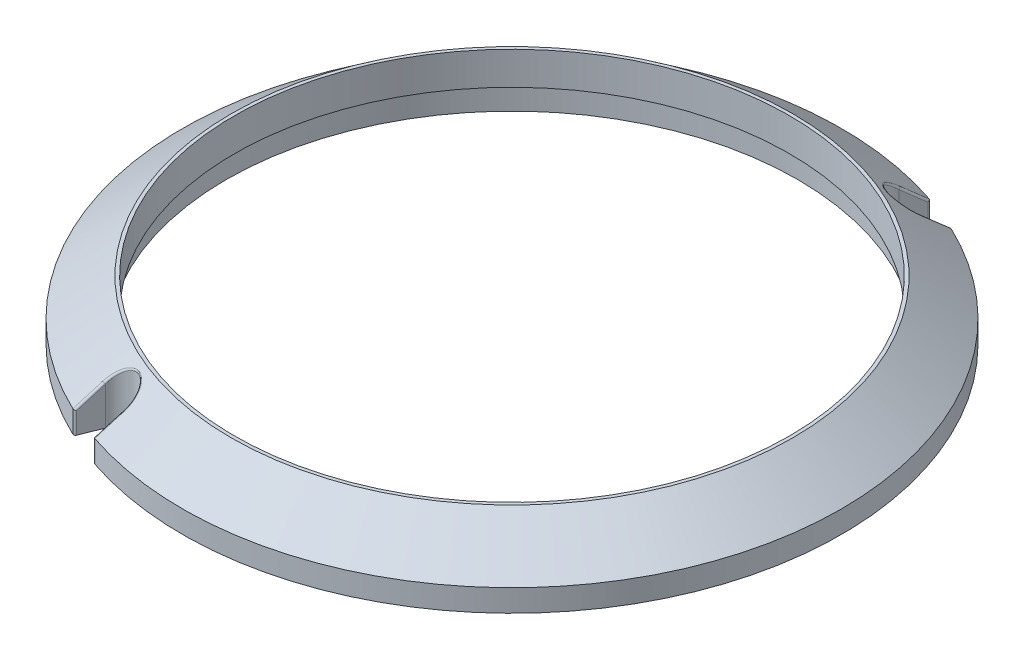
ISO-10303-21;
HEADER;
FILE_DESCRIPTION(('STEP AP214'),'2;1');
FILE_NAME('part.step','',(''),(''),'','','');
FILE_SCHEMA(('AUTOMOTIVE_DESIGN { 1 0 10303 214 1 1 1 1 }'));
ENDSEC;
DATA;
#1=APPLICATION_CONTEXT('core data for automotive mechanical design processes');
#2=APPLICATION_PROTOCOL_DEFINITION('international standard','automotive_design',2000,#1);
#3=PRODUCT_CONTEXT('',#1,'mechanical');
#4=PRODUCT('Part','Part','',(#3));
#5=PRODUCT_RELATED_PRODUCT_CATEGORY('part','',(#4));
#6=PRODUCT_DEFINITION_FORMATION('','',#4);
#7=PRODUCT_DEFINITION_CONTEXT('part definition',#1,'design');
#8=PRODUCT_DEFINITION('design','',#6,#7);
#9=PRODUCT_DEFINITION_SHAPE('','',#8);
#10=(LENGTH_UNIT() NAMED_UNIT(*) SI_UNIT(.MILLI.,.METRE.));
#11=(NAMED_UNIT(*) PLANE_ANGLE_UNIT() SI_UNIT($,.RADIAN.));
#12=(NAMED_UNIT(*) SI_UNIT($,.STERADIAN.) SOLID_ANGLE_UNIT());
#13=UNCERTAINTY_MEASURE_WITH_UNIT(LENGTH_MEASURE(1.E-05),#10,'distance_accuracy_value','');
#14=(GEOMETRIC_REPRESENTATION_CONTEXT(3) GLOBAL_UNCERTAINTY_ASSIGNED_CONTEXT((#13)) GLOBAL_UNIT_ASSIGNED_CONTEXT((#10,
#11,#12)) REPRESENTATION_CONTEXT('',''));
#15=CARTESIAN_POINT('',(0.,0.,0.));
#16=DIRECTION('',(0.,0.,1.));
#17=DIRECTION('',(1.,0.,0.));
#18=AXIS2_PLACEMENT_3D('',#15,#16,#17);
#19=CARTESIAN_POINT('',(0.,0.,0.));
#20=DIRECTION('',(0.,-1.,0.));
#21=DIRECTION('',(1.,0.,0.));
#22=AXIS2_PLACEMENT_3D('',#19,#20,#21);
#23=CYLINDRICAL_SURFACE('',#22,127.);
#24=CARTESIAN_POINT('',(0.,14.8946997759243,0.));
#25=DIRECTION('',(0.,-1.,0.));
#26=DIRECTION('',(1.,0.,0.));
#27=AXIS2_PLACEMENT_3D('',#24,#25,#26);
#28=CIRCLE('',#27,127.);
#29=CARTESIAN_POINT('',(-54.5960739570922,14.8946997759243,114.665900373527));
#30=VERTEX_POINT('',#29);
#31=CARTESIAN_POINT('',(40.3804985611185,14.8946997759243,-120.409365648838));
#32=VERTEX_POINT('',#31);
#33=EDGE_CURVE('E204',#30,#32,#28,.T.);
#34=ORIENTED_EDGE('',*,*,#33,.T.);
#35=DIRECTION('',(0.,-1.,0.));
#36=VECTOR('',#35,1.);
#37=CARTESIAN_POINT('',(40.3804985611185,0.,-120.409365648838));
#38=LINE('',#37,#36);
#39=CARTESIAN_POINT('',(40.3804985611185,6.35000000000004,-120.409365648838));
#40=VERTEX_POINT('',#39);
#41=EDGE_CURVE('E356',#32,#40,#38,.T.);
#42=ORIENTED_EDGE('',*,*,#41,.T.);
#43=CARTESIAN_POINT('',(0.,6.35000000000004,0.));
#44=DIRECTION('',(0.,-1.,0.));
#45=DIRECTION('',(1.,0.,0.));
#46=AXIS2_PLACEMENT_3D('',#43,#44,#45);
#47=CIRCLE('',#46,127.);
#48=CARTESIAN_POINT('',(-54.5960739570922,6.35000000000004,114.665900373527));
#49=VERTEX_POINT('',#48);
#50=EDGE_CURVE('E201',#49,#40,#47,.T.);
#51=ORIENTED_EDGE('',*,*,#50,.F.);
#52=DIRECTION('',(0.,-1.,0.));
#53=VECTOR('',#52,1.);
#54=CARTESIAN_POINT('',(-54.5960739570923,0.,114.665900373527));
#55=LINE('',#54,#53);
#56=EDGE_CURVE('E480',#49,#30,#55,.F.);
#57=ORIENTED_EDGE('',*,*,#56,.T.);
#58=EDGE_LOOP('',(#34,#42,#51,#57));
#59=FACE_BOUND('',#58,.T.);
#60=ADVANCED_FACE('F34',(#59),#23,.T.);
#61=CARTESIAN_POINT('',(0.,0.,0.));
#62=DIRECTION('',(0.,-1.,0.));
#63=DIRECTION('',(1.,0.,0.));
#64=AXIS2_PLACEMENT_3D('',#61,#62,#63);
#65=CYLINDRICAL_SURFACE('',#64,106.9467);
#66=CARTESIAN_POINT('',(0.,29.21,0.));
#67=DIRECTION('',(0.,-1.,0.));
#68=DIRECTION('',(1.,0.,0.));
#69=AXIS2_PLACEMENT_3D('',#66,#67,#68);
#70=CIRCLE('',#69,106.9467);
#71=CARTESIAN_POINT('',(106.9467,29.21,0.));
#72=VERTEX_POINT('',#71);
#73=EDGE_CURVE('E210',#72,#72,#70,.T.);
#74=ORIENTED_EDGE('',*,*,#73,.F.);
#75=EDGE_LOOP('',(#74));
#76=FACE_BOUND('',#75,.T.);
#77=CARTESIAN_POINT('',(0.,16.51,0.));
#78=DIRECTION('',(0.,-1.,0.));
#79=DIRECTION('',(1.,0.,0.));
#80=AXIS2_PLACEMENT_3D('',#77,#78,#79);
#81=CIRCLE('',#80,106.9467);
#82=CARTESIAN_POINT('',(106.9467,16.51,0.));
#83=VERTEX_POINT('',#82);
#84=EDGE_CURVE('E189',#83,#83,#81,.T.);
#85=ORIENTED_EDGE('',*,*,#84,.T.);
#86=EDGE_LOOP('',(#85));
#87=FACE_BOUND('',#86,.T.);
#88=ADVANCED_FACE('F236',(#76,#87),#65,.F.);
#89=CARTESIAN_POINT('',(-106.9467,29.21,0.));
#90=DIRECTION('',(0.,-1.,0.));
#91=DIRECTION('',(1.,0.,0.));
#92=AXIS2_PLACEMENT_3D('',#89,#90,#91);
#93=PLANE('',#92);
#94=CARTESIAN_POINT('',(0.,29.21,0.));
#95=DIRECTION('',(0.,-1.,0.));
#96=DIRECTION('',(1.,0.,0.));
#97=AXIS2_PLACEMENT_3D('',#94,#95,#96);
#98=CIRCLE('',#97,108.2167);
#99=CARTESIAN_POINT('',(108.2167,29.21,0.));
#100=VERTEX_POINT('',#99);
#101=EDGE_CURVE('E207',#100,#100,#98,.T.);
#102=ORIENTED_EDGE('',*,*,#101,.F.);
#103=EDGE_LOOP('',(#102));
#104=FACE_BOUND('',#103,.T.);
#105=ORIENTED_EDGE('',*,*,#73,.T.);
#106=EDGE_LOOP('',(#105));
#107=FACE_BOUND('',#106,.T.);
#108=ADVANCED_FACE('F552',(#104,#107),#93,.F.);
#109=CARTESIAN_POINT('',(0.,29.21,0.));
#110=DIRECTION('',(0.,-1.,0.));
#111=DIRECTION('',(1.,0.,0.));
#112=AXIS2_PLACEMENT_3D('',#109,#110,#111);
#113=CONICAL_SURFACE('',#112,108.2167,0.919577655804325);
#114=CARTESIAN_POINT('',(22.8211810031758,51.0779504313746,-74.7916108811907));
#115=CARTESIAN_POINT('',(23.0041865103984,51.7220133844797,-75.2445654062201));
#116=CARTESIAN_POINT('',(22.2451771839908,51.6840038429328,-75.5201303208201));
#117=CARTESIAN_POINT('',(24.0574863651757,48.5746084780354,-77.8515740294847));
#118=CARTESIAN_POINT('',(24.2386468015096,49.2199029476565,-78.2999618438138));
#119=CARTESIAN_POINT('',(23.4832930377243,49.1806618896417,-78.5795590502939));
#120=CARTESIAN_POINT('',(25.2935404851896,46.0703827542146,-80.9109153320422));
#121=CARTESIAN_POINT('',(25.4745461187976,46.7137821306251,-81.3589199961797));
#122=CARTESIAN_POINT('',(24.7209430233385,46.6764361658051,-81.6384193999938));
#123=CARTESIAN_POINT('',(27.7652628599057,41.0605750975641,-87.0286428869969));
#124=CARTESIAN_POINT('',(27.9455334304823,41.7015049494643,-87.4748282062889));
#125=CARTESIAN_POINT('',(27.1955283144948,41.6666285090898,-87.7552700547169));
#126=CARTESIAN_POINT('',(29.0009311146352,38.5549931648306,-90.0870291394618));
#127=CARTESIAN_POINT('',(29.1812063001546,39.194165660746,-90.5332258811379));
#128=CARTESIAN_POINT('',(28.4324636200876,39.1610465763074,-90.8132603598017));
#129=CARTESIAN_POINT('',(32.7075319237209,31.0368302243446,-99.2611880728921));
#130=CARTESIAN_POINT('',(32.8839460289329,31.6790668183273,-99.6978283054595));
#131=CARTESIAN_POINT('',(32.1425230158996,31.6428836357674,-99.9863260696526));
#132=CARTESIAN_POINT('',(35.1780608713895,26.0228313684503,-105.375961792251));
#133=CARTESIAN_POINT('',(35.3553114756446,26.6608285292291,-105.814672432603));
#134=CARTESIAN_POINT('',(34.6149009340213,26.6288847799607,-106.100497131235));
#135=CARTESIAN_POINT('',(40.9068270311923,14.3922151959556,-119.555155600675));
#136=CARTESIAN_POINT('',(41.0811758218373,15.0310353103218,-119.986684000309));
#137=CARTESIAN_POINT('',(40.3473539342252,14.9982686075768,-120.278472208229));
#138=CARTESIAN_POINT('',(44.1648369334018,7.77480014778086,-127.619013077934));
#139=CARTESIAN_POINT('',(44.3403558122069,8.40898715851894,-128.053437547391));
#140=CARTESIAN_POINT('',(43.6070098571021,8.38085355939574,-128.341770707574));
#141=CARTESIAN_POINT('',(50.680267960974,-5.4620952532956,-143.745270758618));
#142=CARTESIAN_POINT('',(50.8552645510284,-4.83068378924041,-144.178402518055));
#143=CARTESIAN_POINT('',(50.1252385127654,-4.85604184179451,-144.467066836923));
#144=CARTESIAN_POINT('',(53.937689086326,-12.0815756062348,-151.807670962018));
#145=CARTESIAN_POINT('',(54.1132970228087,-11.452983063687,-152.242315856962));
#146=CARTESIAN_POINT('',(53.3838112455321,-11.4755221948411,-152.529064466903));
#147=CARTESIAN_POINT('',(60.4521727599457,-25.3218004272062,-167.931583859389));
#148=CARTESIAN_POINT('',(60.6272770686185,-24.6949255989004,-168.364982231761));
#149=CARTESIAN_POINT('',(59.9002970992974,-24.7157470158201,-168.652271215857));
#150=CARTESIAN_POINT('',(63.709235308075,-31.9425448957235,-175.993096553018));
#151=CARTESIAN_POINT('',(63.8846243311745,-31.3174119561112,-176.427199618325));
#152=CARTESIAN_POINT('',(63.158210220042,-31.3364914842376,-176.713480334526));
#153=CARTESIAN_POINT('',(70.2231148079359,-45.1848937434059,-192.115514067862));
#154=CARTESIAN_POINT('',(70.398391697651,-44.56157810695,-192.549339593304));
#155=CARTESIAN_POINT('',(69.6735860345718,-44.5788403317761,-192.835359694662));
#156=CARTESIAN_POINT('',(73.479931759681,-51.8064981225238,-200.176418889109));
#157=CARTESIAN_POINT('',(73.6557622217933,-51.1851891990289,-200.611614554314));
#158=CARTESIAN_POINT('',(72.9310487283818,-51.20044471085,-200.896029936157));
#159=CARTESIAN_POINT('',(76.7366832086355,-58.4283319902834,-208.237161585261));
#160=CARTESIAN_POINT('',(76.9132837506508,-57.8093982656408,-208.67426326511));
#161=CARTESIAN_POINT('',(76.1883916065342,-57.8222785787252,-208.956557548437));
#162=(BOUNDED_SURFACE() B_SPLINE_SURFACE(3,2,((#114,#115,#116),(#117,#118,#119),(#120,#121,
#122),(#123,#124,#125),(#126,#127,#128),(#129,#130,#131),(#132,#133,#134),(#135,#136,#137),
(#138,#139,#140),(#141,#142,#143),(#144,#145,#146),(#147,#148,#149),(#150,#151,#152),(#153,#154,
#155),(#156,#157,#158),(#159,#160,#161)),.UNSPECIFIED.,.F.,.F.,
.F.) B_SPLINE_SURFACE_WITH_KNOTS((4,2,2,2,2,2,2,4),(3,3),(0.,12.4268622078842,24.8537235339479,
49.707442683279,82.4927356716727,115.278029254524,148.06333544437,180.848639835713),(0.,1.),
.UNSPECIFIED.) GEOMETRIC_REPRESENTATION_ITEM() RATIONAL_B_SPLINE_SURFACE(((1.,0.685924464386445,
1.),(1.,0.686822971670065,1.),(1.,0.687615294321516,1.),(1.,0.689037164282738,1.),(1.,
0.689666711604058,1.),(1.,0.691385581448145,1.),(1.,0.692305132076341,1.),(1.,0.694139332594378,
1.),(1.,0.694958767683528,1.),(1.,0.696351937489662,1.),(1.,0.696925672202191,1.),(1.,
0.69792340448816,1.),(1.,0.698347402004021,1.),(1.,0.699093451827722,1.),(1.,0.699415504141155,
1.),(1.,0.699710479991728,1.))) REPRESENTATION_ITEM('') SURFACE());
#163=CARTESIAN_POINT('',(22.2451771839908,51.6840038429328,-75.5201303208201));
#164=CARTESIAN_POINT('',(23.4832930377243,49.1806618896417,-78.5795590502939));
#165=CARTESIAN_POINT('',(24.7209430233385,46.6764361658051,-81.6384193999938));
#166=CARTESIAN_POINT('',(27.1955283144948,41.6666285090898,-87.7552700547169));
#167=CARTESIAN_POINT('',(28.4324636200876,39.1610465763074,-90.8132603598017));
#168=CARTESIAN_POINT('',(32.1425230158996,31.6428836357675,-99.9863260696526));
#169=CARTESIAN_POINT('',(34.6149009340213,26.6288847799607,-106.100497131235));
#170=CARTESIAN_POINT('',(40.3473539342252,14.9982686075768,-120.278472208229));
#171=CARTESIAN_POINT('',(43.6070098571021,8.38085355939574,-128.341770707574));
#172=CARTESIAN_POINT('',(50.1252385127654,-4.85604184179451,-144.467066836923));
#173=CARTESIAN_POINT('',(53.3838112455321,-11.4755221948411,-152.529064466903));
#174=CARTESIAN_POINT('',(59.9002970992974,-24.7157470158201,-168.652271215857));
#175=CARTESIAN_POINT('',(63.158210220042,-31.3364914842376,-176.713480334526));
#176=CARTESIAN_POINT('',(69.6735860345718,-44.5788403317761,-192.835359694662));
#177=CARTESIAN_POINT('',(72.9310487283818,-51.20044471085,-200.896029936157));
#178=CARTESIAN_POINT('',(76.1883916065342,-57.8222785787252,-208.956557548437));
#179=B_SPLINE_CURVE_WITH_KNOTS('',3,(#163,#164,#165,#166,#167,#168,#169,#170,#171,#172,#173,
#174,#175,#176,#177,#178),.UNSPECIFIED.,.F.,.F.,(4,2,2,2,2,2,2,4),(0.,12.4268622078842,
24.8537235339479,49.707442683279,82.4927356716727,115.278029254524,148.06333544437,
180.848639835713),.UNSPECIFIED.);
#180=CARTESIAN_POINT('',(37.0867125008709,21.6138080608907,-112.213985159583));
#181=VERTEX_POINT('',#180);
#182=CARTESIAN_POINT('',(40.3976862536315,14.8948644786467,-120.403372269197));
#183=VERTEX_POINT('',#182);
#184=EDGE_CURVE('E339',#181,#183,#179,.T.);
#185=ORIENTED_EDGE('',*,*,#184,.T.);
#186=CARTESIAN_POINT('',(40.3976862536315,14.8948644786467,-120.403372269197));
#187=CARTESIAN_POINT('',(40.3948338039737,14.8948095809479,-120.404405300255));
#188=CARTESIAN_POINT('',(40.3919752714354,14.8947684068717,-120.405421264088));
#189=CARTESIAN_POINT('',(40.3862460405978,14.8947135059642,-120.407419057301));
#190=CARTESIAN_POINT('',(40.3833753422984,14.894699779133,-120.408400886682));
#191=CARTESIAN_POINT('',(40.3804985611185,14.8946997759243,-120.409365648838));
#192=B_SPLINE_CURVE_WITH_KNOTS('',3,(#186,#187,#188,#189,#190,#191),.UNSPECIFIED.,.F.,.F.,(4,2,
4),(0.,0.00910196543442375,0.0182039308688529),.UNSPECIFIED.);
#193=EDGE_CURVE('E332',#183,#32,#192,.T.);
#194=ORIENTED_EDGE('',*,*,#193,.T.);
#195=ORIENTED_EDGE('',*,*,#33,.F.);
#196=CARTESIAN_POINT('',(-54.5960739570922,14.8946997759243,114.665900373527));
#197=CARTESIAN_POINT('',(-54.5933343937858,14.894699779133,114.667204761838));
#198=CARTESIAN_POINT('',(-54.5905873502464,14.8947135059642,114.668492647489));
#199=CARTESIAN_POINT('',(-54.5850783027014,14.8947684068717,114.671035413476));
#200=CARTESIAN_POINT('',(-54.5823162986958,14.8948095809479,114.67229029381));
#201=CARTESIAN_POINT('',(-54.5795468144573,14.8948644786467,114.673528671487));
#202=B_SPLINE_CURVE_WITH_KNOTS('',3,(#196,#197,#198,#199,#200,#201),.UNSPECIFIED.,.F.,.F.,(4,2,
4),(0.,0.00910196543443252,0.0182039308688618),.UNSPECIFIED.);
#203=CARTESIAN_POINT('',(-54.5795468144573,14.8948644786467,114.673528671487));
#204=VERTEX_POINT('',#203);
#205=EDGE_CURVE('E222',#30,#204,#202,.T.);
#206=ORIENTED_EDGE('',*,*,#205,.T.);
#207=CARTESIAN_POINT('',(-36.4588493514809,51.6840038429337,69.7774339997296));
#208=CARTESIAN_POINT('',(-35.721440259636,51.7220133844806,70.1064613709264));
#209=CARTESIAN_POINT('',(-35.5384347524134,51.0779504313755,69.653506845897));
#210=CARTESIAN_POINT('',(-37.6934811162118,49.1806618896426,72.8382703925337));
#211=CARTESIAN_POINT('',(-36.9559005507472,49.2199029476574,73.1618578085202));
#212=CARTESIAN_POINT('',(-36.7747401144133,48.5746084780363,72.7134699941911));
#213=CARTESIAN_POINT('',(-38.9280531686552,46.6764361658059,75.8983743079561));
#214=CARTESIAN_POINT('',(-38.1917998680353,46.7137821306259,76.2208159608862));
#215=CARTESIAN_POINT('',(-38.0107942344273,46.0703827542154,75.7728112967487));
#216=CARTESIAN_POINT('',(-41.3971069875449,41.6666285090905,82.0174598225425));
#217=CARTESIAN_POINT('',(-40.6627871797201,41.7015049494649,82.3367241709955));
#218=CARTESIAN_POINT('',(-40.4825166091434,41.0605750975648,81.8905388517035));
#219=CARTESIAN_POINT('',(-42.6315887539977,39.161046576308,85.0764414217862));
#220=CARTESIAN_POINT('',(-41.8984600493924,39.1941656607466,85.3951218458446));
#221=CARTESIAN_POINT('',(-41.718184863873,38.5549931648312,84.9489251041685));
#222=CARTESIAN_POINT('',(-46.3349422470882,31.6428836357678,94.2522164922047));
#223=CARTESIAN_POINT('',(-45.6011997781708,31.6790668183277,94.5597242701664));
#224=CARTESIAN_POINT('',(-45.4247856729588,31.0368302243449,94.123084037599));
#225=CARTESIAN_POINT('',(-48.8037225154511,26.6288847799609,100.367841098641));
#226=CARTESIAN_POINT('',(-48.0725652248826,26.6608285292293,100.67656839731));
#227=CARTESIAN_POINT('',(-47.8953146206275,26.0228313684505,100.237857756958));
#228=CARTESIAN_POINT('',(-54.5289899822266,14.9982686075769,114.548719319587));
#229=CARTESIAN_POINT('',(-53.7984295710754,15.0310353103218,114.848579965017));
#230=CARTESIAN_POINT('',(-53.6240807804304,14.3922151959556,114.417051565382));
#231=CARTESIAN_POINT('',(-57.7854275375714,8.38085355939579,122.613318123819));
#232=CARTESIAN_POINT('',(-57.057609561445,8.40898715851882,122.915333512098));
#233=CARTESIAN_POINT('',(-56.8820906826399,7.7748001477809,122.480909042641));
#234=CARTESIAN_POINT('',(-64.2981781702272,-4.85604184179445,138.740827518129));
#235=CARTESIAN_POINT('',(-63.5725183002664,-4.83068378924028,139.040298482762));
#236=CARTESIAN_POINT('',(-63.3975217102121,-5.46209525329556,138.607166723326));
#237=CARTESIAN_POINT('',(-67.5544912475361,-11.4755221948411,146.803738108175));
#238=CARTESIAN_POINT('',(-66.8305507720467,-11.4529830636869,147.104211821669));
#239=CARTESIAN_POINT('',(-66.6549428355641,-12.0815756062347,146.669566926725));
#240=CARTESIAN_POINT('',(-74.0670441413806,-24.7157470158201,162.928533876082));
#241=CARTESIAN_POINT('',(-73.3445308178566,-24.6949255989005,163.226878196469));
#242=CARTESIAN_POINT('',(-73.1694265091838,-25.3218004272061,162.793479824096));
#243=CARTESIAN_POINT('',(-77.3232839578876,-31.3364914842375,170.990419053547));
#244=CARTESIAN_POINT('',(-76.6018780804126,-31.3174119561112,171.289095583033));
#245=CARTESIAN_POINT('',(-76.4264890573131,-31.9425448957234,170.854992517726));
#246=CARTESIAN_POINT('',(-83.8357132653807,-44.5788403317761,187.1134888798));
#247=CARTESIAN_POINT('',(-83.115645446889,-44.5615781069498,187.411235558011));
#248=CARTESIAN_POINT('',(-82.940368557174,-45.1848937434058,186.977410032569));
#249=CARTESIAN_POINT('',(-87.0919027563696,-51.2004447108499,195.174673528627));
#250=CARTESIAN_POINT('',(-86.3730159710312,-51.1851891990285,195.473510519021));
#251=CARTESIAN_POINT('',(-86.1971855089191,-51.8064981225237,195.038314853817));
#252=CARTESIAN_POINT('',(-90.3480793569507,-57.8222785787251,203.235672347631));
#253=CARTESIAN_POINT('',(-89.6305374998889,-57.8093982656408,203.536159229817));
#254=CARTESIAN_POINT('',(-89.4539369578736,-58.4283319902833,203.099057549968));
#255=(BOUNDED_SURFACE() B_SPLINE_SURFACE(3,2,((#207,#208,#209),(#210,#211,#212),(#213,#214,
#215),(#216,#217,#218),(#219,#220,#221),(#222,#223,#224),(#225,#226,#227),(#228,#229,#230),
(#231,#232,#233),(#234,#235,#236),(#237,#238,#239),(#240,#241,#242),(#243,#244,#245),(#246,#247,
#248),(#249,#250,#251),(#252,#253,#254)),.UNSPECIFIED.,.F.,.F.,
.F.) B_SPLINE_SURFACE_WITH_KNOTS((4,2,2,2,2,2,2,4),(3,3),(0.,12.4268622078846,24.8537235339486,
49.7074426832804,82.4927356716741,115.278029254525,148.063335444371,180.848639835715),(0.,1.),
.UNSPECIFIED.) GEOMETRIC_REPRESENTATION_ITEM() RATIONAL_B_SPLINE_SURFACE(((1.,0.685924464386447,
1.),(1.,0.686822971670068,1.),(1.,0.68761529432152,1.),(1.,0.689037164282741,1.),(1.,
0.689666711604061,1.),(1.,0.691385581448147,1.),(1.,0.692305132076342,1.),(1.,0.694139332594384,
1.),(1.,0.694958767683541,1.),(1.,0.696351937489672,1.),(1.,0.69692567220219,1.),(1.,
0.697923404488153,1.),(1.,0.698347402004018,1.),(1.,0.699093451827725,1.),(1.,0.699415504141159,
1.),(1.,0.699710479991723,1.))) REPRESENTATION_ITEM('') SURFACE());
#256=CARTESIAN_POINT('',(-90.3480793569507,-57.8222785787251,203.235672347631));
#257=CARTESIAN_POINT('',(-87.0919027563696,-51.20044471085,195.174673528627));
#258=CARTESIAN_POINT('',(-83.8357132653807,-44.5788403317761,187.1134888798));
#259=CARTESIAN_POINT('',(-77.3232839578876,-31.3364914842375,170.990419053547));
#260=CARTESIAN_POINT('',(-74.0670441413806,-24.7157470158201,162.928533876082));
#261=CARTESIAN_POINT('',(-67.5544912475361,-11.4755221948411,146.803738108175));
#262=CARTESIAN_POINT('',(-64.2981781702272,-4.85604184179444,138.740827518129));
#263=CARTESIAN_POINT('',(-57.7854275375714,8.38085355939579,122.613318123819));
#264=CARTESIAN_POINT('',(-54.5289899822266,14.9982686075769,114.548719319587));
#265=CARTESIAN_POINT('',(-48.8037225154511,26.6288847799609,100.367841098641));
#266=CARTESIAN_POINT('',(-46.3349422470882,31.6428836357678,94.2522164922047));
#267=CARTESIAN_POINT('',(-42.6315887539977,39.161046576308,85.0764414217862));
#268=CARTESIAN_POINT('',(-41.3971069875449,41.6666285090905,82.0174598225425));
#269=CARTESIAN_POINT('',(-38.9280531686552,46.6764361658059,75.8983743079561));
#270=CARTESIAN_POINT('',(-37.6934811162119,49.1806618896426,72.8382703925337));
#271=CARTESIAN_POINT('',(-36.4588493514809,51.6840038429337,69.7774339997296));
#272=B_SPLINE_CURVE_WITH_KNOTS('',3,(#256,#257,#258,#259,#260,#261,#262,#263,#264,#265,#266,
#267,#268,#269,#270,#271),.UNSPECIFIED.,.F.,.F.,(4,2,2,2,2,2,2,4),(0.,32.7853043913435,
65.5706105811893,98.3559041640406,131.141197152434,155.994916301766,168.42177762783,
180.848639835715),.UNSPECIFIED.);
#273=CARTESIAN_POINT('',(-51.2724357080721,21.6138080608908,106.482580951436));
#274=VERTEX_POINT('',#273);
#275=EDGE_CURVE('E215',#204,#274,#272,.T.);
#276=ORIENTED_EDGE('',*,*,#275,.T.);
#277=CARTESIAN_POINT('',(-50.8623443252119,18.7198487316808,109.108481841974));
#278=CARTESIAN_POINT('',(-50.8468230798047,19.5547407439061,109.675797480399));
#279=CARTESIAN_POINT('',(-51.8215735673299,19.325902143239,109.546851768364));
#280=CARTESIAN_POINT('',(-50.8689089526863,18.9017835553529,108.867693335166));
#281=CARTESIAN_POINT('',(-50.8731639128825,19.7133658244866,109.43411289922));
#282=CARTESIAN_POINT('',(-51.829286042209,19.5078369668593,109.279111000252));
#283=CARTESIAN_POINT('',(-50.862779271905,19.0868799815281,108.628616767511));
#284=CARTESIAN_POINT('',(-50.8867643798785,19.8784197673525,109.18881072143));
#285=CARTESIAN_POINT('',(-51.8228490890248,19.6929333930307,109.013292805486));
#286=CARTESIAN_POINT('',(-50.8262006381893,19.461847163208,108.155575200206));
#287=CARTESIAN_POINT('',(-50.8871919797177,20.2156048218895,108.700141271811));
#288=CARTESIAN_POINT('',(-51.7828641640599,20.0679005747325,108.487377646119));
#289=CARTESIAN_POINT('',(-50.7957640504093,19.6517154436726,107.921607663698));
#290=CARTESIAN_POINT('',(-50.8746709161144,20.3875781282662,108.456705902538));
#291=CARTESIAN_POINT('',(-51.749329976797,20.2577688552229,108.227277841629));
#292=CARTESIAN_POINT('',(-50.7116527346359,20.0348322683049,107.46026373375));
#293=CARTESIAN_POINT('',(-50.8235190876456,20.7370063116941,107.973969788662));
#294=CARTESIAN_POINT('',(-51.6563519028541,20.640885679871,107.714444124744));
#295=CARTESIAN_POINT('',(-50.6579820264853,20.2280802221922,107.2328862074));
#296=CARTESIAN_POINT('',(-50.7854830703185,20.9143781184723,107.734514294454));
#297=CARTESIAN_POINT('',(-51.5969124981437,20.8341336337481,107.461708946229));
#298=CARTESIAN_POINT('',(-50.5283258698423,20.6166385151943,106.786108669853));
#299=CARTESIAN_POINT('',(-50.6840875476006,21.27295708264,107.261898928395));
#300=CARTESIAN_POINT('',(-51.4531493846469,21.2226919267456,106.965145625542));
#301=CARTESIAN_POINT('',(-50.4523373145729,20.8119491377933,106.566709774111));
#302=CARTESIAN_POINT('',(-50.6212582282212,21.4541470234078,107.028515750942));
#303=CARTESIAN_POINT('',(-51.3688222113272,21.41800254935,106.721318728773));
#304=CARTESIAN_POINT('',(-50.1922031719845,21.3987600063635,105.922858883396));
#305=CARTESIAN_POINT('',(-50.3981932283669,21.9953633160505,106.34812646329));
#306=CARTESIAN_POINT('',(-51.07996084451,22.0048134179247,106.00584386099));
#307=CARTESIAN_POINT('',(-49.9757542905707,21.7917388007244,105.512031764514));
#308=CARTESIAN_POINT('',(-50.2014009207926,22.3651443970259,105.904235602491));
#309=CARTESIAN_POINT('',(-50.8393977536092,22.397792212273,105.549400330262));
#310=CARTESIAN_POINT('',(-49.4617531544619,22.5706965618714,104.738503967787));
#311=CARTESIAN_POINT('',(-49.7127161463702,23.1020003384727,105.06547673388));
#312=CARTESIAN_POINT('',(-50.267775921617,23.1767499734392,104.690170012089));
#313=CARTESIAN_POINT('',(-49.1641921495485,22.9566747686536,104.37580848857));
#314=CARTESIAN_POINT('',(-49.4237324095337,23.4700070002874,104.667875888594));
#315=CARTESIAN_POINT('',(-49.9367074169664,23.5627281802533,104.287389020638));
#316=CARTESIAN_POINT('',(-48.5349010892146,23.6615009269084,103.753788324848));
#317=CARTESIAN_POINT('',(-48.7974697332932,24.1450636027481,103.983305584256));
#318=CARTESIAN_POINT('',(-49.2362823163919,24.2675543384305,103.596833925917));
#319=CARTESIAN_POINT('',(-48.2124481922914,23.9826095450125,103.487171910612));
#320=CARTESIAN_POINT('',(-48.4737112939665,24.4537172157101,103.687722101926));
#321=CARTESIAN_POINT('',(-48.8772823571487,24.5886629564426,103.30093508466));
#322=CARTESIAN_POINT('',(-47.5114129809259,24.600394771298,103.010781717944));
#323=CARTESIAN_POINT('',(-47.7618038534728,25.0480277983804,103.158561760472));
#324=CARTESIAN_POINT('',(-48.0965876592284,25.2064481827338,102.7724440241));
#325=CARTESIAN_POINT('',(-47.1329039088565,24.8971024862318,102.800934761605));
#326=CARTESIAN_POINT('',(-47.374430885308,25.3350397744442,102.92269466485));
#327=CARTESIAN_POINT('',(-47.6749747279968,25.503155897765,102.539770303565));
#328=CARTESIAN_POINT('',(-46.411574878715,25.3928337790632,102.489040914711));
#329=CARTESIAN_POINT('',(-46.6296935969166,25.8152898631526,102.570019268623));
#330=CARTESIAN_POINT('',(-46.8713215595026,25.9988871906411,102.19422582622));
#331=CARTESIAN_POINT('',(-46.0786496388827,25.5991272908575,102.373507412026));
#332=CARTESIAN_POINT('',(-46.2851316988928,26.0154607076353,102.437875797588));
#333=CARTESIAN_POINT('',(-46.5003417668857,26.2051807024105,102.06634178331));
#334=CARTESIAN_POINT('',(-45.3853977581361,25.9800128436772,102.193378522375));
#335=CARTESIAN_POINT('',(-45.5655577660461,26.3846568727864,102.229651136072));
#336=CARTESIAN_POINT('',(-45.7277229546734,26.5860662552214,101.867256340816));
#337=CARTESIAN_POINT('',(-45.025104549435,26.1546427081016,102.128722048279));
#338=CARTESIAN_POINT('',(-45.19011675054,26.554613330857,102.152459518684));
#339=CARTESIAN_POINT('',(-45.326121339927,26.7606961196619,101.795986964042));
#340=CARTESIAN_POINT('',(-44.3469866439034,26.4363446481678,102.064397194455));
#341=CARTESIAN_POINT('',(-44.4820879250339,26.8284879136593,102.070570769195));
#342=CARTESIAN_POINT('',(-44.5701374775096,27.0423980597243,101.725626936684));
#343=CARTESIAN_POINT('',(-44.0322479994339,26.5498434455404,102.055607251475));
#344=CARTESIAN_POINT('',(-44.1528980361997,26.9390798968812,102.05535910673));
#345=CARTESIAN_POINT('',(-44.2192150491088,27.1558968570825,101.71639007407));
#346=CARTESIAN_POINT('',(-43.5553732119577,26.6939185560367,102.075947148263));
#347=CARTESIAN_POINT('',(-43.6534024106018,27.0794421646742,102.069321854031));
#348=CARTESIAN_POINT('',(-43.6874492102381,27.2999719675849,101.739811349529));
#349=CARTESIAN_POINT('',(-43.3955735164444,26.737590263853,102.088323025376));
#350=CARTESIAN_POINT('',(-43.486179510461,27.1219543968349,102.080041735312));
#351=CARTESIAN_POINT('',(-43.5092445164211,27.3436436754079,101.753840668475));
#352=CARTESIAN_POINT('',(-43.0754481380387,26.8155418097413,102.124567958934));
#353=CARTESIAN_POINT('',(-43.1512185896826,27.1978018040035,102.114020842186));
#354=CARTESIAN_POINT('',(-43.1522261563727,27.4215952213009,101.794676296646));
#355=CARTESIAN_POINT('',(-42.9151227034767,26.8498255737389,102.148432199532));
#356=CARTESIAN_POINT('',(-42.9833712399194,27.2311910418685,102.137251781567));
#357=CARTESIAN_POINT('',(-42.9734127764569,27.4558789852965,101.821477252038));
#358=CARTESIAN_POINT('',(-42.5942228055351,26.908577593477,102.208004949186));
#359=CARTESIAN_POINT('',(-42.6475283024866,27.2883776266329,102.196613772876));
#360=CARTESIAN_POINT('',(-42.6154857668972,27.5146310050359,101.888245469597));
#361=CARTESIAN_POINT('',(-42.4336523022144,26.9329876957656,102.243781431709));
#362=CARTESIAN_POINT('',(-42.4794146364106,27.3121590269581,102.232813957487));
#363=CARTESIAN_POINT('',(-42.4363764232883,27.5390411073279,101.928288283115));
#364=CARTESIAN_POINT('',(-42.1146204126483,26.9712365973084,102.327095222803));
#365=CARTESIAN_POINT('',(-42.1455881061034,27.3493983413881,102.318026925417));
#366=CARTESIAN_POINT('',(-42.08048776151,27.5772900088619,102.021442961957));
#367=CARTESIAN_POINT('',(-41.956158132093,26.9850800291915,102.374627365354));
#368=CARTESIAN_POINT('',(-41.9797483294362,27.3628881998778,102.367048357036));
#369=CARTESIAN_POINT('',(-41.9037074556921,27.5911334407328,102.074549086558));
#370=CARTESIAN_POINT('',(-41.6426752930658,27.0019351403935,102.481205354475));
#371=CARTESIAN_POINT('',(-41.6519384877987,27.3793007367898,102.477615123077));
#372=CARTESIAN_POINT('',(-41.5539640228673,27.607988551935,102.193552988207));
#373=CARTESIAN_POINT('',(-41.4876546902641,27.0049469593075,102.540251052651));
#374=CARTESIAN_POINT('',(-41.4898426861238,27.3822359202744,102.53919458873));
#375=CARTESIAN_POINT('',(-41.3810008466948,27.6110003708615,102.259450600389));
#376=CARTESIAN_POINT('',(-41.1824293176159,27.0000782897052,102.669368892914));
#377=CARTESIAN_POINT('',(-41.1710246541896,27.3774949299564,102.674324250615));
#378=CARTESIAN_POINT('',(-41.0404255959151,27.6061317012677,102.403493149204));
#379=CARTESIAN_POINT('',(-41.0322242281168,26.9921985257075,102.739440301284));
#380=CARTESIAN_POINT('',(-41.0141822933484,27.3698158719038,102.747926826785));
#381=CARTESIAN_POINT('',(-40.8728131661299,27.5982519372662,102.481637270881));
#382=CARTESIAN_POINT('',(-40.7510933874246,26.9668951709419,102.883170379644));
#383=CARTESIAN_POINT('',(-40.7210256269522,27.3451792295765,102.899214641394));
#384=CARTESIAN_POINT('',(-40.5590811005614,27.5729485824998,102.641878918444));
#385=CARTESIAN_POINT('',(-40.6196466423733,26.9503907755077,102.955943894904));
#386=CARTESIAN_POINT('',(-40.5840346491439,27.3290993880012,102.976002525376));
#387=CARTESIAN_POINT('',(-40.4123819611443,27.5564441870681,102.722993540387));
#388=CARTESIAN_POINT('',(-40.3625966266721,26.9087669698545,103.109417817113));
#389=CARTESIAN_POINT('',(-40.3165083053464,27.2885779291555,103.138143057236));
#390=CARTESIAN_POINT('',(-40.1254873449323,27.5148203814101,102.894022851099));
#391=CARTESIAN_POINT('',(-40.2369953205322,26.8836446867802,103.190120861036));
#392=CARTESIAN_POINT('',(-40.1859038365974,27.2641091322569,103.223559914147));
#393=CARTESIAN_POINT('',(-39.9852940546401,27.4896980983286,102.983940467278));
#394=CARTESIAN_POINT('',(-39.8701708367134,26.7959072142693,103.443010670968));
#395=CARTESIAN_POINT('',(-39.804714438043,27.1786247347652,103.491698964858));
#396=CARTESIAN_POINT('',(-39.5758264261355,27.4019606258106,103.265657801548));
#397=CARTESIAN_POINT('',(-39.6386716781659,26.7208974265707,103.626109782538));
#398=CARTESIAN_POINT('',(-39.5649153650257,27.1054764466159,103.686317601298));
#399=CARTESIAN_POINT('',(-39.3173792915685,27.3269508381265,103.469568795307));
#400=CARTESIAN_POINT('',(-39.1976887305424,26.538527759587,104.022452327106));
#401=CARTESIAN_POINT('',(-39.1102116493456,26.9281048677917,104.107447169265));
#402=CARTESIAN_POINT('',(-38.8249939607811,27.1445811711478,103.910855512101));
#403=CARTESIAN_POINT('',(-38.9894060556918,26.4300266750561,104.236589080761));
#404=CARTESIAN_POINT('',(-38.8964113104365,26.8224129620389,104.335494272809));
#405=CARTESIAN_POINT('',(-38.5923940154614,27.0360800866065,104.149221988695));
#406=CARTESIAN_POINT('',(-38.607221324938,26.1870703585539,104.682770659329));
#407=CARTESIAN_POINT('',(-38.5065461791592,26.5864189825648,104.810064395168));
#408=CARTESIAN_POINT('',(-38.1655148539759,26.7931237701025,104.645798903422));
#409=CARTESIAN_POINT('',(-38.4333383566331,26.0526007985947,104.914825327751));
#410=CARTESIAN_POINT('',(-38.3304555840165,26.4556534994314,105.057226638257));
#411=CARTESIAN_POINT('',(-37.9712569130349,26.6586542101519,104.904020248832));
#412=CARTESIAN_POINT('',(-38.0539708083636,25.7014634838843,105.49179166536));
#413=CARTESIAN_POINT('',(-37.9487615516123,26.1143733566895,105.672054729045));
#414=CARTESIAN_POINT('',(-37.5473413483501,26.3075168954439,105.545955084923));
#415=CARTESIAN_POINT('',(-37.8660895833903,25.4740477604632,105.843022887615));
#416=CARTESIAN_POINT('',(-37.763633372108,25.8934629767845,106.045987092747));
#417=CARTESIAN_POINT('',(-37.3373096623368,26.0801011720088,105.93666247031));
#418=CARTESIAN_POINT('',(-37.5570514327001,24.9889132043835,106.557915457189));
#419=CARTESIAN_POINT('',(-37.4655910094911,25.4243966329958,106.804333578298));
#420=CARTESIAN_POINT('',(-36.9916553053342,25.5949666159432,106.731783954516));
#421=CARTESIAN_POINT('',(-37.4360387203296,24.7311303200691,106.921601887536));
#422=CARTESIAN_POINT('',(-37.353826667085,25.1750377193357,107.189974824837));
#423=CARTESIAN_POINT('',(-36.8561934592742,25.3371837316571,107.136225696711));
#424=CARTESIAN_POINT('',(-37.2351101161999,24.1298921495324,107.740606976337));
#425=CARTESIAN_POINT('',(-37.178292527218,24.5945793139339,108.05714653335));
#426=CARTESIAN_POINT('',(-36.6309872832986,24.7359455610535,108.046898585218));
#427=CARTESIAN_POINT('',(-37.1722740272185,23.7808195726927,108.196761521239));
#428=CARTESIAN_POINT('',(-37.1356425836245,24.2585333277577,108.537909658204));
#429=CARTESIAN_POINT('',(-36.5602926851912,24.3868729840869,108.554032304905));
#430=CARTESIAN_POINT('',(-37.1363634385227,23.064890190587,109.100427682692));
#431=CARTESIAN_POINT('',(-37.1449223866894,23.5738203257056,109.484231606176));
#432=CARTESIAN_POINT('',(-36.5190277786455,23.6709436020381,109.558562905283));
#433=CARTESIAN_POINT('',(-37.1632495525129,22.6980412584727,109.547943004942));
#434=CARTESIAN_POINT('',(-37.1998962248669,23.2237946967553,109.950621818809));
#435=CARTESIAN_POINT('',(-36.548413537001,23.3040946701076,110.055963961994));
#436=CARTESIAN_POINT('',(-37.2727753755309,22.1088713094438,110.244593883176));
#437=CARTESIAN_POINT('',(-37.355185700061,22.6697175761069,110.665828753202));
#438=CARTESIAN_POINT('',(-36.6696253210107,22.7149247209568,110.83018068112));
#439=CARTESIAN_POINT('',(-37.3280851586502,21.888863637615,110.499942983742));
#440=CARTESIAN_POINT('',(-37.4293219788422,22.4619581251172,110.928630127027));
#441=CARTESIAN_POINT('',(-36.7309651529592,22.494917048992,111.113940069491));
#442=CARTESIAN_POINT('',(-37.4670610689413,21.4483656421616,111.001868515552));
#443=CARTESIAN_POINT('',(-37.606914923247,22.0477705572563,111.442498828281));
#444=CARTESIAN_POINT('',(-36.8852764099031,22.054419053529,111.671670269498));
#445=CARTESIAN_POINT('',(-37.5506929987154,21.22787621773,111.248455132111));
#446=CARTESIAN_POINT('',(-37.7110713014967,21.8412202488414,111.693499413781));
#447=CARTESIAN_POINT('',(-36.9782096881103,21.8339296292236,111.945652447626));
#448=CARTESIAN_POINT('',(-37.8213035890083,20.6174917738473,111.918176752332));
#449=CARTESIAN_POINT('',(-38.0422961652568,21.2671303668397,112.377007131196));
#450=CARTESIAN_POINT('',(-37.2790817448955,21.22354518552,112.689723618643));
#451=CARTESIAN_POINT('',(-38.0381982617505,20.2283851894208,112.3304527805));
#452=CARTESIAN_POINT('',(-38.3001540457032,20.9076714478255,112.787891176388));
#453=CARTESIAN_POINT('',(-37.5203910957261,20.8344386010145,113.147703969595));
#454=CARTESIAN_POINT('',(-38.4273823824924,19.6542407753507,112.915481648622));
#455=CARTESIAN_POINT('',(-38.7420909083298,20.3898315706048,113.355328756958));
#456=CARTESIAN_POINT('',(-37.9535712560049,20.260294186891,113.797485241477));
#457=CARTESIAN_POINT('',(-38.5683214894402,19.4638339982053,113.105497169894));
#458=CARTESIAN_POINT('',(-38.9025502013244,20.2173723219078,113.539691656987));
#459=CARTESIAN_POINT('',(-38.110469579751,20.0698874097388,114.008513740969));
#460=CARTESIAN_POINT('',(-38.8712961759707,19.0878775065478,113.472190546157));
#461=CARTESIAN_POINT('',(-39.2430933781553,19.8793143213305,113.891861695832));
#462=CARTESIAN_POINT('',(-38.4478005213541,19.6939309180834,114.415718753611));
#463=CARTESIAN_POINT('',(-39.0333353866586,18.9023286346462,113.648866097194));
#464=CARTESIAN_POINT('',(-39.4236922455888,19.713870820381,114.059269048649));
#465=CARTESIAN_POINT('',(-38.6282371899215,19.5083820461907,114.611892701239));
#466=CARTESIAN_POINT('',(-39.2058115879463,18.7198487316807,113.818026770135));
#467=CARTESIAN_POINT('',(-39.6110671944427,19.5547407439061,114.215337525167));
#468=CARTESIAN_POINT('',(-38.8203171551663,19.325902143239,114.799700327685));
#469=(BOUNDED_SURFACE() B_SPLINE_SURFACE(3,2,((#277,#278,#279),(#280,#281,#282),(#283,#284,
#285),(#286,#287,#288),(#289,#290,#291),(#292,#293,#294),(#295,#296,#297),(#298,#299,#300),
(#301,#302,#303),(#304,#305,#306),(#307,#308,#309),(#310,#311,#312),(#313,#314,#315),(#316,#317,
#318),(#319,#320,#321),(#322,#323,#324),(#325,#326,#327),(#328,#329,#330),(#331,#332,#333),
(#334,#335,#336),(#337,#338,#339),(#340,#341,#342),(#343,#344,#345),(#346,#347,#348),(#349,#350,
#351),(#352,#353,#354),(#355,#356,#357),(#358,#359,#360),(#361,#362,#363),(#364,#365,#366),
(#367,#368,#369),(#370,#371,#372),(#373,#374,#375),(#376,#377,#378),(#379,#380,#381),(#382,#383,
#384),(#385,#386,#387),(#388,#389,#390),(#391,#392,#393),(#394,#395,#396),(#397,#398,#399),
(#400,#401,#402),(#403,#404,#405),(#406,#407,#408),(#409,#410,#411),(#412,#413,#414),(#415,#416,
#417),(#418,#419,#420),(#421,#422,#423),(#424,#425,#426),(#427,#428,#429),(#430,#431,#432),
(#433,#434,#435),(#436,#437,#438),(#439,#440,#441),(#442,#443,#444),(#445,#446,#447),(#448,#449,
#450),(#451,#452,#453),(#454,#455,#456),(#457,#458,#459),(#460,#461,#462),(#463,#464,#465),
(#466,#467,#468)),.UNSPECIFIED.,.F.,.F.,.F.) B_SPLINE_SURFACE_WITH_KNOTS((4,2,2,2,2,2,2,2,2,2,2,
2,2,2,2,2,2,2,2,2,2,2,2,2,2,2,2,2,2,2,2,4),(3,3),(0.,0.970376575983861,1.94025982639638,
2.90997533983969,3.87982590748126,5.81652709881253,7.7534373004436,9.44192692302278,
11.1282295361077,12.4510325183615,13.7722448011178,14.8706244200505,15.420132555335,
15.9694105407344,16.521878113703,17.0741033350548,17.6263214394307,18.1785028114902,
18.6811679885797,19.1840008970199,20.1887177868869,21.232377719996,22.2766151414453,
23.7612800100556,25.2491344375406,27.0977565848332,28.9455673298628,30.0369302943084,
31.1269801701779,33.0595758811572,34.0323024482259,35.0051966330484),(0.,1.),
.UNSPECIFIED.) GEOMETRIC_REPRESENTATION_ITEM() RATIONAL_B_SPLINE_SURFACE(((1.,0.602455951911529,
1.),(1.,0.610112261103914,1.),(1.,0.617775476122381,1.),(1.,0.633062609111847,1.),(1.,
0.640686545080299,1.),(1.,0.655848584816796,1.),(1.,0.663386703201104,1.),(1.,0.678340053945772,
1.),(1.,0.685755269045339,1.),(1.,0.707754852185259,1.),(1.,0.722116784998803,1.),(1.,
0.74998192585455,1.),(1.,0.763485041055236,1.),(1.,0.787706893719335,1.),(1.,0.798560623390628,
1.),(1.,0.819171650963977,1.),(1.,0.828930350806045,1.),(1.,0.845066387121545,1.),(1.,
0.851719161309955,1.),(1.,0.863921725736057,1.),(1.,0.869472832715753,1.),(1.,0.878384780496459,
1.),(1.,0.881957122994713,1.),(1.,0.886479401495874,1.),(1.,0.887847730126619,1.),(1.,
0.890287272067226,1.),(1.,0.891358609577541,1.),(1.,0.893193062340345,1.),(1.,0.893954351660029,
1.),(1.,0.895146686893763,1.),(1.,0.895577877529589,1.),(1.,0.896102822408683,1.),(1.,
0.896196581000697,1.),(1.,0.896044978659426,1.),(1.,0.8957996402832,1.),(1.,0.895011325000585,
1.),(1.,0.894497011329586,1.),(1.,0.893198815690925,1.),(1.,0.892414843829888,1.),(1.,
0.889673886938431,1.),(1.,0.887327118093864,1.),(1.,0.881600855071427,1.),(1.,0.878184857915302,
1.),(1.,0.87049876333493,1.),(1.,0.866228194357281,1.),(1.,0.855011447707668,1.),(1.,
0.84769646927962,1.),(1.,0.831929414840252,1.),(1.,0.823474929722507,1.),(1.,0.803515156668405,
1.),(1.,0.791767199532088,1.),(1.,0.767235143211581,1.),(1.,0.754451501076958,1.),(1.,
0.733489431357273,1.),(1.,0.725568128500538,1.),(1.,0.709497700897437,1.),(1.,0.701348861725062,
1.),(1.,0.678464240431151,1.),(1.,0.663505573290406,1.),(1.,0.640787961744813,1.),(1.,
0.633143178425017,1.),(1.,0.61781657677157,1.),(1.,0.610134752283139,1.),(1.,0.602455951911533,1.))) REPRESENTATION_ITEM('') SURFACE());
#470=CARTESIAN_POINT('',(-51.8215735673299,19.325902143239,109.546851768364));
#471=CARTESIAN_POINT('',(-51.829286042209,19.5078369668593,109.279111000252));
#472=CARTESIAN_POINT('',(-51.8228490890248,19.6929333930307,109.013292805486));
#473=CARTESIAN_POINT('',(-51.7828641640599,20.0679005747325,108.487377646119));
#474=CARTESIAN_POINT('',(-51.749329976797,20.2577688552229,108.227277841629));
#475=CARTESIAN_POINT('',(-51.6563519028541,20.640885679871,107.714444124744));
#476=CARTESIAN_POINT('',(-51.5969124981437,20.8341336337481,107.461708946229));
#477=CARTESIAN_POINT('',(-51.4531493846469,21.2226919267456,106.965145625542));
#478=CARTESIAN_POINT('',(-51.3688222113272,21.41800254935,106.721318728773));
#479=CARTESIAN_POINT('',(-51.07996084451,22.0048134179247,106.00584386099));
#480=CARTESIAN_POINT('',(-50.8393977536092,22.397792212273,105.549400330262));
#481=CARTESIAN_POINT('',(-50.267775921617,23.1767499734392,104.690170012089));
#482=CARTESIAN_POINT('',(-49.9367074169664,23.5627281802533,104.287389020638));
#483=CARTESIAN_POINT('',(-49.2362823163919,24.2675543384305,103.596833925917));
#484=CARTESIAN_POINT('',(-48.8772823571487,24.5886629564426,103.30093508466));
#485=CARTESIAN_POINT('',(-48.0965876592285,25.2064481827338,102.7724440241));
#486=CARTESIAN_POINT('',(-47.6749747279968,25.503155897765,102.539770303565));
#487=CARTESIAN_POINT('',(-46.8713215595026,25.9988871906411,102.19422582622));
#488=CARTESIAN_POINT('',(-46.5003417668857,26.2051807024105,102.06634178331));
#489=CARTESIAN_POINT('',(-45.7277229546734,26.5860662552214,101.867256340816));
#490=CARTESIAN_POINT('',(-45.326121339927,26.7606961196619,101.795986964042));
#491=CARTESIAN_POINT('',(-44.5701374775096,27.0423980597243,101.725626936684));
#492=CARTESIAN_POINT('',(-44.2192150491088,27.1558968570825,101.71639007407));
#493=CARTESIAN_POINT('',(-43.6874492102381,27.2999719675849,101.739811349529));
#494=CARTESIAN_POINT('',(-43.5092445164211,27.3436436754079,101.753840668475));
#495=CARTESIAN_POINT('',(-43.1522261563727,27.4215952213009,101.794676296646));
#496=CARTESIAN_POINT('',(-42.9734127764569,27.4558789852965,101.821477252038));
#497=CARTESIAN_POINT('',(-42.6154857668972,27.5146310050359,101.888245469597));
#498=CARTESIAN_POINT('',(-42.4363764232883,27.5390411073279,101.928288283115));
#499=CARTESIAN_POINT('',(-42.08048776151,27.5772900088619,102.021442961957));
#500=CARTESIAN_POINT('',(-41.9037074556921,27.5911334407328,102.074549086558));
#501=CARTESIAN_POINT('',(-41.5539640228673,27.607988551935,102.193552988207));
#502=CARTESIAN_POINT('',(-41.3810008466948,27.6110003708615,102.259450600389));
#503=CARTESIAN_POINT('',(-41.0404255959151,27.6061317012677,102.403493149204));
#504=CARTESIAN_POINT('',(-40.8728131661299,27.5982519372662,102.481637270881));
#505=CARTESIAN_POINT('',(-40.5590811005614,27.5729485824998,102.641878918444));
#506=CARTESIAN_POINT('',(-40.4123819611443,27.5564441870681,102.722993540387));
#507=CARTESIAN_POINT('',(-40.1254873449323,27.5148203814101,102.894022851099));
#508=CARTESIAN_POINT('',(-39.9852940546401,27.4896980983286,102.983940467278));
#509=CARTESIAN_POINT('',(-39.5758264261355,27.4019606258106,103.265657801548));
#510=CARTESIAN_POINT('',(-39.3173792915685,27.3269508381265,103.469568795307));
#511=CARTESIAN_POINT('',(-38.8249939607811,27.1445811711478,103.910855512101));
#512=CARTESIAN_POINT('',(-38.5923940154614,27.0360800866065,104.149221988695));
#513=CARTESIAN_POINT('',(-38.1655148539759,26.7931237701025,104.645798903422));
#514=CARTESIAN_POINT('',(-37.9712569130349,26.6586542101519,104.904020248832));
#515=CARTESIAN_POINT('',(-37.54734134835,26.3075168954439,105.545955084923));
#516=CARTESIAN_POINT('',(-37.3373096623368,26.0801011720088,105.93666247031));
#517=CARTESIAN_POINT('',(-36.9916553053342,25.5949666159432,106.731783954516));
#518=CARTESIAN_POINT('',(-36.8561934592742,25.3371837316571,107.136225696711));
#519=CARTESIAN_POINT('',(-36.6309872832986,24.7359455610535,108.046898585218));
#520=CARTESIAN_POINT('',(-36.5602926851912,24.3868729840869,108.554032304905));
#521=CARTESIAN_POINT('',(-36.5190277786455,23.6709436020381,109.558562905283));
#522=CARTESIAN_POINT('',(-36.548413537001,23.3040946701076,110.055963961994));
#523=CARTESIAN_POINT('',(-36.6696253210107,22.7149247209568,110.83018068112));
#524=CARTESIAN_POINT('',(-36.7309651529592,22.494917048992,111.113940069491));
#525=CARTESIAN_POINT('',(-36.8852764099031,22.054419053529,111.671670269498));
#526=CARTESIAN_POINT('',(-36.9782096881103,21.8339296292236,111.945652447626));
#527=CARTESIAN_POINT('',(-37.2790817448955,21.22354518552,112.689723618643));
#528=CARTESIAN_POINT('',(-37.5203910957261,20.8344386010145,113.147703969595));
#529=CARTESIAN_POINT('',(-37.9535712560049,20.260294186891,113.797485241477));
#530=CARTESIAN_POINT('',(-38.110469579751,20.0698874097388,114.008513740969));
#531=CARTESIAN_POINT('',(-38.4478005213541,19.6939309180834,114.415718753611));
#532=CARTESIAN_POINT('',(-38.6282371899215,19.5083820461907,114.611892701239));
#533=CARTESIAN_POINT('',(-38.8203171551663,19.325902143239,114.799700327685));
#534=B_SPLINE_CURVE_WITH_KNOTS('',3,(#470,#471,#472,#473,#474,#475,#476,#477,#478,#479,#480,
#481,#482,#483,#484,#485,#486,#487,#488,#489,#490,#491,#492,#493,#494,#495,#496,#497,#498,#499,
#500,#501,#502,#503,#504,#505,#506,#507,#508,#509,#510,#511,#512,#513,#514,#515,#516,#517,#518,
#519,#520,#521,#522,#523,#524,#525,#526,#527,#528,#529,#530,#531,#532,#533),.UNSPECIFIED.,.F.,
.F.,(4,2,2,2,2,2,2,2,2,2,2,2,2,2,2,2,2,2,2,2,2,2,2,2,2,2,2,2,2,2,2,4),(0.,0.970376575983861,
1.94025982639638,2.90997533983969,3.87982590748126,5.81652709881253,7.7534373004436,
9.44192692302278,11.1282295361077,12.4510325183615,13.7722448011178,14.8706244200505,
15.420132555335,15.9694105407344,16.521878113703,17.0741033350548,17.6263214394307,
18.1785028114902,18.6811679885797,19.1840008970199,20.1887177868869,21.232377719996,
22.2766151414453,23.7612800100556,25.2491344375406,27.0977565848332,28.9455673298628,
30.0369302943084,31.1269801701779,33.0595758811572,34.0323024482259,35.0051966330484),.UNSPECIFIED.);
#535=CARTESIAN_POINT('',(-37.0867125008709,21.6138080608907,112.213985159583));
#536=VERTEX_POINT('',#535);
#537=EDGE_CURVE('E477',#274,#536,#534,.T.);
#538=ORIENTED_EDGE('',*,*,#537,.T.);
#539=CARTESIAN_POINT('',(-22.8211810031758,51.0779504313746,74.7916108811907));
#540=CARTESIAN_POINT('',(-23.0041865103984,51.7220133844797,75.2445654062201));
#541=CARTESIAN_POINT('',(-22.2451771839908,51.6840038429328,75.5201303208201));
#542=CARTESIAN_POINT('',(-24.0574863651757,48.5746084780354,77.8515740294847));
#543=CARTESIAN_POINT('',(-24.2386468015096,49.2199029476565,78.2999618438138));
#544=CARTESIAN_POINT('',(-23.4832930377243,49.1806618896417,78.5795590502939));
#545=CARTESIAN_POINT('',(-25.2935404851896,46.0703827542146,80.9109153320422));
#546=CARTESIAN_POINT('',(-25.4745461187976,46.7137821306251,81.3589199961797));
#547=CARTESIAN_POINT('',(-24.7209430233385,46.6764361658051,81.6384193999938));
#548=CARTESIAN_POINT('',(-27.7652628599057,41.0605750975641,87.0286428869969));
#549=CARTESIAN_POINT('',(-27.9455334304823,41.7015049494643,87.4748282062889));
#550=CARTESIAN_POINT('',(-27.1955283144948,41.6666285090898,87.7552700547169));
#551=CARTESIAN_POINT('',(-29.0009311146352,38.5549931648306,90.0870291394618));
#552=CARTESIAN_POINT('',(-29.1812063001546,39.194165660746,90.5332258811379));
#553=CARTESIAN_POINT('',(-28.4324636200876,39.1610465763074,90.8132603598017));
#554=CARTESIAN_POINT('',(-32.7075319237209,31.0368302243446,99.2611880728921));
#555=CARTESIAN_POINT('',(-32.8839460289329,31.6790668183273,99.6978283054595));
#556=CARTESIAN_POINT('',(-32.1425230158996,31.6428836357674,99.9863260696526));
#557=CARTESIAN_POINT('',(-35.1780608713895,26.0228313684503,105.375961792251));
#558=CARTESIAN_POINT('',(-35.3553114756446,26.6608285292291,105.814672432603));
#559=CARTESIAN_POINT('',(-34.6149009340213,26.6288847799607,106.100497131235));
#560=CARTESIAN_POINT('',(-40.9068270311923,14.3922151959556,119.555155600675));
#561=CARTESIAN_POINT('',(-41.0811758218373,15.0310353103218,119.986684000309));
#562=CARTESIAN_POINT('',(-40.3473539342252,14.9982686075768,120.278472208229));
#563=CARTESIAN_POINT('',(-44.1648369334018,7.77480014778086,127.619013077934));
#564=CARTESIAN_POINT('',(-44.3403558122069,8.40898715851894,128.053437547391));
#565=CARTESIAN_POINT('',(-43.6070098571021,8.38085355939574,128.341770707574));
#566=CARTESIAN_POINT('',(-50.680267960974,-5.4620952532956,143.745270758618));
#567=CARTESIAN_POINT('',(-50.8552645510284,-4.83068378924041,144.178402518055));
#568=CARTESIAN_POINT('',(-50.1252385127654,-4.85604184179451,144.467066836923));
#569=CARTESIAN_POINT('',(-53.937689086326,-12.0815756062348,151.807670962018));
#570=CARTESIAN_POINT('',(-54.1132970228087,-11.452983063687,152.242315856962));
#571=CARTESIAN_POINT('',(-53.3838112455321,-11.4755221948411,152.529064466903));
#572=CARTESIAN_POINT('',(-60.4521727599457,-25.3218004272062,167.931583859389));
#573=CARTESIAN_POINT('',(-60.6272770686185,-24.6949255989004,168.364982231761));
#574=CARTESIAN_POINT('',(-59.9002970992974,-24.7157470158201,168.652271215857));
#575=CARTESIAN_POINT('',(-63.709235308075,-31.9425448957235,175.993096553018));
#576=CARTESIAN_POINT('',(-63.8846243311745,-31.3174119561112,176.427199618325));
#577=CARTESIAN_POINT('',(-63.158210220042,-31.3364914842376,176.713480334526));
#578=CARTESIAN_POINT('',(-70.2231148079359,-45.1848937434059,192.115514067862));
#579=CARTESIAN_POINT('',(-70.398391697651,-44.56157810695,192.549339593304));
#580=CARTESIAN_POINT('',(-69.6735860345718,-44.5788403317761,192.835359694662));
#581=CARTESIAN_POINT('',(-73.479931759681,-51.8064981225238,200.176418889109));
#582=CARTESIAN_POINT('',(-73.6557622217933,-51.1851891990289,200.611614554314));
#583=CARTESIAN_POINT('',(-72.9310487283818,-51.20044471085,200.896029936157));
#584=CARTESIAN_POINT('',(-76.7366832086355,-58.4283319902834,208.237161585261));
#585=CARTESIAN_POINT('',(-76.9132837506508,-57.8093982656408,208.67426326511));
#586=CARTESIAN_POINT('',(-76.1883916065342,-57.8222785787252,208.956557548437));
#587=(BOUNDED_SURFACE() B_SPLINE_SURFACE(3,2,((#539,#540,#541),(#542,#543,#544),(#545,#546,
#547),(#548,#549,#550),(#551,#552,#553),(#554,#555,#556),(#557,#558,#559),(#560,#561,#562),
(#563,#564,#565),(#566,#567,#568),(#569,#570,#571),(#572,#573,#574),(#575,#576,#577),(#578,#579,
#580),(#581,#582,#583),(#584,#585,#586)),.UNSPECIFIED.,.F.,.F.,
.F.) B_SPLINE_SURFACE_WITH_KNOTS((4,2,2,2,2,2,2,4),(3,3),(0.,12.4268622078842,24.8537235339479,
49.707442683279,82.4927356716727,115.278029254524,148.06333544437,180.848639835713),(0.,1.),
.UNSPECIFIED.) GEOMETRIC_REPRESENTATION_ITEM() RATIONAL_B_SPLINE_SURFACE(((1.,0.685924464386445,
1.),(1.,0.686822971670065,1.),(1.,0.687615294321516,1.),(1.,0.689037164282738,1.),(1.,
0.689666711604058,1.),(1.,0.691385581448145,1.),(1.,0.692305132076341,1.),(1.,0.694139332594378,
1.),(1.,0.694958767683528,1.),(1.,0.696351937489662,1.),(1.,0.696925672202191,1.),(1.,
0.69792340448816,1.),(1.,0.698347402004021,1.),(1.,0.699093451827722,1.),(1.,0.699415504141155,
1.),(1.,0.699710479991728,1.))) REPRESENTATION_ITEM('') SURFACE());
#588=CARTESIAN_POINT('',(-22.2451771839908,51.6840038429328,75.5201303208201));
#589=CARTESIAN_POINT('',(-23.4832930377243,49.1806618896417,78.5795590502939));
#590=CARTESIAN_POINT('',(-24.7209430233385,46.6764361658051,81.6384193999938));
#591=CARTESIAN_POINT('',(-27.1955283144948,41.6666285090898,87.7552700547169));
#592=CARTESIAN_POINT('',(-28.4324636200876,39.1610465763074,90.8132603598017));
#593=CARTESIAN_POINT('',(-32.1425230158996,31.6428836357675,99.9863260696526));
#594=CARTESIAN_POINT('',(-34.6149009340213,26.6288847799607,106.100497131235));
#595=CARTESIAN_POINT('',(-40.3473539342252,14.9982686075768,120.278472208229));
#596=CARTESIAN_POINT('',(-43.6070098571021,8.38085355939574,128.341770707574));
#597=CARTESIAN_POINT('',(-50.1252385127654,-4.85604184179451,144.467066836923));
#598=CARTESIAN_POINT('',(-53.3838112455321,-11.4755221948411,152.529064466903));
#599=CARTESIAN_POINT('',(-59.9002970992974,-24.7157470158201,168.652271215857));
#600=CARTESIAN_POINT('',(-63.158210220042,-31.3364914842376,176.713480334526));
#601=CARTESIAN_POINT('',(-69.6735860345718,-44.5788403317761,192.835359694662));
#602=CARTESIAN_POINT('',(-72.9310487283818,-51.20044471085,200.896029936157));
#603=CARTESIAN_POINT('',(-76.1883916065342,-57.8222785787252,208.956557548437));
#604=B_SPLINE_CURVE_WITH_KNOTS('',3,(#588,#589,#590,#591,#592,#593,#594,#595,#596,#597,#598,
#599,#600,#601,#602,#603),.UNSPECIFIED.,.F.,.F.,(4,2,2,2,2,2,2,4),(0.,12.4268622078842,
24.8537235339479,49.707442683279,82.4927356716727,115.278029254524,148.06333544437,
180.848639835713),.UNSPECIFIED.);
#605=CARTESIAN_POINT('',(-40.3976862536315,14.8948644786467,120.403372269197));
#606=VERTEX_POINT('',#605);
#607=EDGE_CURVE('E474',#536,#606,#604,.T.);
#608=ORIENTED_EDGE('',*,*,#607,.T.);
#609=CARTESIAN_POINT('',(-40.3976862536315,14.8948644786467,120.403372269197));
#610=CARTESIAN_POINT('',(-40.3948338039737,14.8948095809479,120.404405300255));
#611=CARTESIAN_POINT('',(-40.3919752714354,14.8947684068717,120.405421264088));
#612=CARTESIAN_POINT('',(-40.3862460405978,14.8947135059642,120.407419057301));
#613=CARTESIAN_POINT('',(-40.3833753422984,14.894699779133,120.408400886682));
#614=CARTESIAN_POINT('',(-40.3804985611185,14.8946997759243,120.409365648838));
#615=B_SPLINE_CURVE_WITH_KNOTS('',3,(#609,#610,#611,#612,#613,#614),.UNSPECIFIED.,.F.,.F.,(4,2,
4),(0.,0.00910196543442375,0.0182039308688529),.UNSPECIFIED.);
#616=CARTESIAN_POINT('',(-40.3804985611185,14.8946997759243,120.409365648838));
#617=VERTEX_POINT('',#616);
#618=EDGE_CURVE('E375',#606,#617,#615,.T.);
#619=ORIENTED_EDGE('',*,*,#618,.T.);
#620=CARTESIAN_POINT('',(54.5960739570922,14.8946997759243,-114.665900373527));
#621=VERTEX_POINT('',#620);
#622=EDGE_CURVE('E203',#621,#617,#28,.T.);
#623=ORIENTED_EDGE('',*,*,#622,.F.);
#624=CARTESIAN_POINT('',(54.5960739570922,14.8946997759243,-114.665900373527));
#625=CARTESIAN_POINT('',(54.5933343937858,14.894699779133,-114.667204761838));
#626=CARTESIAN_POINT('',(54.5905873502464,14.8947135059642,-114.668492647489));
#627=CARTESIAN_POINT('',(54.5850783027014,14.8947684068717,-114.671035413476));
#628=CARTESIAN_POINT('',(54.5823162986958,14.8948095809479,-114.67229029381));
#629=CARTESIAN_POINT('',(54.5795468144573,14.8948644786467,-114.673528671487));
#630=B_SPLINE_CURVE_WITH_KNOTS('',3,(#624,#625,#626,#627,#628,#629),.UNSPECIFIED.,.F.,.F.,(4,2,
4),(0.,0.00910196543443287,0.0182039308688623),.UNSPECIFIED.);
#631=CARTESIAN_POINT('',(54.5795468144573,14.8948644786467,-114.673528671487));
#632=VERTEX_POINT('',#631);
#633=EDGE_CURVE('E371',#621,#632,#630,.T.);
#634=ORIENTED_EDGE('',*,*,#633,.T.);
#635=CARTESIAN_POINT('',(36.4588493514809,51.6840038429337,-69.7774339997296));
#636=CARTESIAN_POINT('',(35.721440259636,51.7220133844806,-70.1064613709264));
#637=CARTESIAN_POINT('',(35.5384347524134,51.0779504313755,-69.653506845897));
#638=CARTESIAN_POINT('',(37.6934811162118,49.1806618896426,-72.8382703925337));
#639=CARTESIAN_POINT('',(36.9559005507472,49.2199029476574,-73.1618578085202));
#640=CARTESIAN_POINT('',(36.7747401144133,48.5746084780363,-72.7134699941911));
#641=CARTESIAN_POINT('',(38.9280531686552,46.6764361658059,-75.8983743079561));
#642=CARTESIAN_POINT('',(38.1917998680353,46.7137821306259,-76.2208159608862));
#643=CARTESIAN_POINT('',(38.0107942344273,46.0703827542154,-75.7728112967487));
#644=CARTESIAN_POINT('',(41.3971069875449,41.6666285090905,-82.0174598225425));
#645=CARTESIAN_POINT('',(40.6627871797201,41.7015049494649,-82.3367241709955));
#646=CARTESIAN_POINT('',(40.4825166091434,41.0605750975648,-81.8905388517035));
#647=CARTESIAN_POINT('',(42.6315887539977,39.161046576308,-85.0764414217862));
#648=CARTESIAN_POINT('',(41.8984600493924,39.1941656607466,-85.3951218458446));
#649=CARTESIAN_POINT('',(41.718184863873,38.5549931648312,-84.9489251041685));
#650=CARTESIAN_POINT('',(46.3349422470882,31.6428836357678,-94.2522164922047));
#651=CARTESIAN_POINT('',(45.6011997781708,31.6790668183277,-94.5597242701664));
#652=CARTESIAN_POINT('',(45.4247856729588,31.0368302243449,-94.123084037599));
#653=CARTESIAN_POINT('',(48.8037225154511,26.6288847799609,-100.367841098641));
#654=CARTESIAN_POINT('',(48.0725652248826,26.6608285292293,-100.67656839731));
#655=CARTESIAN_POINT('',(47.8953146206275,26.0228313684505,-100.237857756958));
#656=CARTESIAN_POINT('',(54.5289899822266,14.9982686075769,-114.548719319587));
#657=CARTESIAN_POINT('',(53.7984295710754,15.0310353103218,-114.848579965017));
#658=CARTESIAN_POINT('',(53.6240807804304,14.3922151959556,-114.417051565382));
#659=CARTESIAN_POINT('',(57.7854275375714,8.38085355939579,-122.613318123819));
#660=CARTESIAN_POINT('',(57.057609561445,8.40898715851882,-122.915333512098));
#661=CARTESIAN_POINT('',(56.8820906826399,7.7748001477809,-122.480909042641));
#662=CARTESIAN_POINT('',(64.2981781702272,-4.85604184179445,-138.740827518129));
#663=CARTESIAN_POINT('',(63.5725183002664,-4.83068378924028,-139.040298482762));
#664=CARTESIAN_POINT('',(63.3975217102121,-5.46209525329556,-138.607166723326));
#665=CARTESIAN_POINT('',(67.5544912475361,-11.4755221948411,-146.803738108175));
#666=CARTESIAN_POINT('',(66.8305507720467,-11.4529830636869,-147.104211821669));
#667=CARTESIAN_POINT('',(66.6549428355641,-12.0815756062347,-146.669566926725));
#668=CARTESIAN_POINT('',(74.0670441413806,-24.7157470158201,-162.928533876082));
#669=CARTESIAN_POINT('',(73.3445308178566,-24.6949255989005,-163.226878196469));
#670=CARTESIAN_POINT('',(73.1694265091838,-25.3218004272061,-162.793479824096));
#671=CARTESIAN_POINT('',(77.3232839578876,-31.3364914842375,-170.990419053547));
#672=CARTESIAN_POINT('',(76.6018780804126,-31.3174119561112,-171.289095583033));
#673=CARTESIAN_POINT('',(76.4264890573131,-31.9425448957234,-170.854992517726));
#674=CARTESIAN_POINT('',(83.8357132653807,-44.5788403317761,-187.1134888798));
#675=CARTESIAN_POINT('',(83.115645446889,-44.5615781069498,-187.411235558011));
#676=CARTESIAN_POINT('',(82.940368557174,-45.1848937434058,-186.977410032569));
#677=CARTESIAN_POINT('',(87.0919027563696,-51.2004447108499,-195.174673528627));
#678=CARTESIAN_POINT('',(86.3730159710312,-51.1851891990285,-195.473510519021));
#679=CARTESIAN_POINT('',(86.1971855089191,-51.8064981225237,-195.038314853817));
#680=CARTESIAN_POINT('',(90.3480793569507,-57.8222785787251,-203.235672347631));
#681=CARTESIAN_POINT('',(89.6305374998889,-57.8093982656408,-203.536159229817));
#682=CARTESIAN_POINT('',(89.4539369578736,-58.4283319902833,-203.099057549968));
#683=(BOUNDED_SURFACE() B_SPLINE_SURFACE(3,2,((#635,#636,#637),(#638,#639,#640),(#641,#642,
#643),(#644,#645,#646),(#647,#648,#649),(#650,#651,#652),(#653,#654,#655),(#656,#657,#658),
(#659,#660,#661),(#662,#663,#664),(#665,#666,#667),(#668,#669,#670),(#671,#672,#673),(#674,#675,
#676),(#677,#678,#679),(#680,#681,#682)),.UNSPECIFIED.,.F.,.F.,
.F.) B_SPLINE_SURFACE_WITH_KNOTS((4,2,2,2,2,2,2,4),(3,3),(0.,12.4268622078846,24.8537235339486,
49.7074426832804,82.4927356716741,115.278029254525,148.063335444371,180.848639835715),(0.,1.),
.UNSPECIFIED.) GEOMETRIC_REPRESENTATION_ITEM() RATIONAL_B_SPLINE_SURFACE(((1.,0.685924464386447,
1.),(1.,0.686822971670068,1.),(1.,0.68761529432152,1.),(1.,0.689037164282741,1.),(1.,
0.689666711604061,1.),(1.,0.691385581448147,1.),(1.,0.692305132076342,1.),(1.,0.694139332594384,
1.),(1.,0.694958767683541,1.),(1.,0.696351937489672,1.),(1.,0.69692567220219,1.),(1.,
0.697923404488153,1.),(1.,0.698347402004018,1.),(1.,0.699093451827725,1.),(1.,0.699415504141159,
1.),(1.,0.699710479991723,1.))) REPRESENTATION_ITEM('') SURFACE());
#684=CARTESIAN_POINT('',(90.3480793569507,-57.8222785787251,-203.235672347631));
#685=CARTESIAN_POINT('',(87.0919027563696,-51.20044471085,-195.174673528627));
#686=CARTESIAN_POINT('',(83.8357132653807,-44.5788403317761,-187.1134888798));
#687=CARTESIAN_POINT('',(77.3232839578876,-31.3364914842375,-170.990419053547));
#688=CARTESIAN_POINT('',(74.0670441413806,-24.7157470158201,-162.928533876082));
#689=CARTESIAN_POINT('',(67.5544912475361,-11.4755221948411,-146.803738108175));
#690=CARTESIAN_POINT('',(64.2981781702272,-4.85604184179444,-138.740827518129));
#691=CARTESIAN_POINT('',(57.7854275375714,8.38085355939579,-122.613318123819));
#692=CARTESIAN_POINT('',(54.5289899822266,14.9982686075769,-114.548719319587));
#693=CARTESIAN_POINT('',(48.8037225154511,26.6288847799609,-100.367841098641));
#694=CARTESIAN_POINT('',(46.3349422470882,31.6428836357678,-94.2522164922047));
#695=CARTESIAN_POINT('',(42.6315887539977,39.161046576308,-85.0764414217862));
#696=CARTESIAN_POINT('',(41.3971069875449,41.6666285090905,-82.0174598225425));
#697=CARTESIAN_POINT('',(38.9280531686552,46.6764361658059,-75.8983743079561));
#698=CARTESIAN_POINT('',(37.6934811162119,49.1806618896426,-72.8382703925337));
#699=CARTESIAN_POINT('',(36.4588493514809,51.6840038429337,-69.7774339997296));
#700=B_SPLINE_CURVE_WITH_KNOTS('',3,(#684,#685,#686,#687,#688,#689,#690,#691,#692,#693,#694,
#695,#696,#697,#698,#699),.UNSPECIFIED.,.F.,.F.,(4,2,2,2,2,2,2,4),(0.,32.7853043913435,
65.5706105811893,98.3559041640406,131.141197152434,155.994916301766,168.42177762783,
180.848639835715),.UNSPECIFIED.);
#701=CARTESIAN_POINT('',(51.2724357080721,21.6138080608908,-106.482580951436));
#702=VERTEX_POINT('',#701);
#703=EDGE_CURVE('E379',#632,#702,#700,.T.);
#704=ORIENTED_EDGE('',*,*,#703,.T.);
#705=CARTESIAN_POINT('',(50.8623443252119,18.7198487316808,-109.108481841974));
#706=CARTESIAN_POINT('',(50.8468230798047,19.5547407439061,-109.675797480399));
#707=CARTESIAN_POINT('',(51.8215735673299,19.325902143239,-109.546851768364));
#708=CARTESIAN_POINT('',(50.8689089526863,18.9017835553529,-108.867693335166));
#709=CARTESIAN_POINT('',(50.8731639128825,19.7133658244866,-109.43411289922));
#710=CARTESIAN_POINT('',(51.829286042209,19.5078369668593,-109.279111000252));
#711=CARTESIAN_POINT('',(50.862779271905,19.0868799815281,-108.628616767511));
#712=CARTESIAN_POINT('',(50.8867643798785,19.8784197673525,-109.18881072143));
#713=CARTESIAN_POINT('',(51.8228490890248,19.6929333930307,-109.013292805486));
#714=CARTESIAN_POINT('',(50.8262006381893,19.461847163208,-108.155575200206));
#715=CARTESIAN_POINT('',(50.8871919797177,20.2156048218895,-108.700141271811));
#716=CARTESIAN_POINT('',(51.7828641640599,20.0679005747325,-108.487377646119));
#717=CARTESIAN_POINT('',(50.7957640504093,19.6517154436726,-107.921607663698));
#718=CARTESIAN_POINT('',(50.8746709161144,20.3875781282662,-108.456705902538));
#719=CARTESIAN_POINT('',(51.749329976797,20.2577688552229,-108.227277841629));
#720=CARTESIAN_POINT('',(50.7116527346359,20.0348322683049,-107.46026373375));
#721=CARTESIAN_POINT('',(50.8235190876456,20.7370063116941,-107.973969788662));
#722=CARTESIAN_POINT('',(51.6563519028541,20.640885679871,-107.714444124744));
#723=CARTESIAN_POINT('',(50.6579820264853,20.2280802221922,-107.2328862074));
#724=CARTESIAN_POINT('',(50.7854830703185,20.9143781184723,-107.734514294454));
#725=CARTESIAN_POINT('',(51.5969124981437,20.8341336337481,-107.461708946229));
#726=CARTESIAN_POINT('',(50.5283258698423,20.6166385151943,-106.786108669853));
#727=CARTESIAN_POINT('',(50.6840875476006,21.27295708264,-107.261898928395));
#728=CARTESIAN_POINT('',(51.4531493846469,21.2226919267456,-106.965145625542));
#729=CARTESIAN_POINT('',(50.4523373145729,20.8119491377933,-106.566709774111));
#730=CARTESIAN_POINT('',(50.6212582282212,21.4541470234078,-107.028515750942));
#731=CARTESIAN_POINT('',(51.3688222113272,21.41800254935,-106.721318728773));
#732=CARTESIAN_POINT('',(50.1922031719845,21.3987600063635,-105.922858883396));
#733=CARTESIAN_POINT('',(50.3981932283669,21.9953633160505,-106.34812646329));
#734=CARTESIAN_POINT('',(51.07996084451,22.0048134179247,-106.00584386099));
#735=CARTESIAN_POINT('',(49.9757542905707,21.7917388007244,-105.512031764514));
#736=CARTESIAN_POINT('',(50.2014009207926,22.3651443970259,-105.904235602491));
#737=CARTESIAN_POINT('',(50.8393977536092,22.397792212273,-105.549400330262));
#738=CARTESIAN_POINT('',(49.4617531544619,22.5706965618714,-104.738503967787));
#739=CARTESIAN_POINT('',(49.7127161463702,23.1020003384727,-105.06547673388));
#740=CARTESIAN_POINT('',(50.267775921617,23.1767499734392,-104.690170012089));
#741=CARTESIAN_POINT('',(49.1641921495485,22.9566747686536,-104.37580848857));
#742=CARTESIAN_POINT('',(49.4237324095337,23.4700070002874,-104.667875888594));
#743=CARTESIAN_POINT('',(49.9367074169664,23.5627281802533,-104.287389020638));
#744=CARTESIAN_POINT('',(48.5349010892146,23.6615009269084,-103.753788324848));
#745=CARTESIAN_POINT('',(48.7974697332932,24.1450636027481,-103.983305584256));
#746=CARTESIAN_POINT('',(49.2362823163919,24.2675543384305,-103.596833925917));
#747=CARTESIAN_POINT('',(48.2124481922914,23.9826095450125,-103.487171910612));
#748=CARTESIAN_POINT('',(48.4737112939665,24.4537172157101,-103.687722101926));
#749=CARTESIAN_POINT('',(48.8772823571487,24.5886629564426,-103.30093508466));
#750=CARTESIAN_POINT('',(47.5114129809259,24.600394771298,-103.010781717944));
#751=CARTESIAN_POINT('',(47.7618038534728,25.0480277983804,-103.158561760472));
#752=CARTESIAN_POINT('',(48.0965876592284,25.2064481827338,-102.7724440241));
#753=CARTESIAN_POINT('',(47.1329039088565,24.8971024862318,-102.800934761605));
#754=CARTESIAN_POINT('',(47.374430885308,25.3350397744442,-102.92269466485));
#755=CARTESIAN_POINT('',(47.6749747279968,25.503155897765,-102.539770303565));
#756=CARTESIAN_POINT('',(46.411574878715,25.3928337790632,-102.489040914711));
#757=CARTESIAN_POINT('',(46.6296935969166,25.8152898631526,-102.570019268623));
#758=CARTESIAN_POINT('',(46.8713215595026,25.9988871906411,-102.19422582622));
#759=CARTESIAN_POINT('',(46.0786496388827,25.5991272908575,-102.373507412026));
#760=CARTESIAN_POINT('',(46.2851316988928,26.0154607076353,-102.437875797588));
#761=CARTESIAN_POINT('',(46.5003417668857,26.2051807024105,-102.06634178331));
#762=CARTESIAN_POINT('',(45.3853977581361,25.9800128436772,-102.193378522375));
#763=CARTESIAN_POINT('',(45.5655577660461,26.3846568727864,-102.229651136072));
#764=CARTESIAN_POINT('',(45.7277229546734,26.5860662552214,-101.867256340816));
#765=CARTESIAN_POINT('',(45.025104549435,26.1546427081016,-102.128722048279));
#766=CARTESIAN_POINT('',(45.19011675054,26.554613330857,-102.152459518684));
#767=CARTESIAN_POINT('',(45.326121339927,26.7606961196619,-101.795986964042));
#768=CARTESIAN_POINT('',(44.3469866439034,26.4363446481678,-102.064397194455));
#769=CARTESIAN_POINT('',(44.4820879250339,26.8284879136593,-102.070570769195));
#770=CARTESIAN_POINT('',(44.5701374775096,27.0423980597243,-101.725626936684));
#771=CARTESIAN_POINT('',(44.0322479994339,26.5498434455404,-102.055607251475));
#772=CARTESIAN_POINT('',(44.1528980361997,26.9390798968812,-102.05535910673));
#773=CARTESIAN_POINT('',(44.2192150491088,27.1558968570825,-101.71639007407));
#774=CARTESIAN_POINT('',(43.5553732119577,26.6939185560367,-102.075947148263));
#775=CARTESIAN_POINT('',(43.6534024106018,27.0794421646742,-102.069321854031));
#776=CARTESIAN_POINT('',(43.6874492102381,27.2999719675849,-101.739811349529));
#777=CARTESIAN_POINT('',(43.3955735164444,26.737590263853,-102.088323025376));
#778=CARTESIAN_POINT('',(43.486179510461,27.1219543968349,-102.080041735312));
#779=CARTESIAN_POINT('',(43.5092445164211,27.3436436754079,-101.753840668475));
#780=CARTESIAN_POINT('',(43.0754481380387,26.8155418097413,-102.124567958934));
#781=CARTESIAN_POINT('',(43.1512185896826,27.1978018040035,-102.114020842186));
#782=CARTESIAN_POINT('',(43.1522261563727,27.4215952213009,-101.794676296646));
#783=CARTESIAN_POINT('',(42.9151227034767,26.8498255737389,-102.148432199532));
#784=CARTESIAN_POINT('',(42.9833712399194,27.2311910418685,-102.137251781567));
#785=CARTESIAN_POINT('',(42.9734127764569,27.4558789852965,-101.821477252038));
#786=CARTESIAN_POINT('',(42.5942228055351,26.908577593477,-102.208004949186));
#787=CARTESIAN_POINT('',(42.6475283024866,27.2883776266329,-102.196613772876));
#788=CARTESIAN_POINT('',(42.6154857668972,27.5146310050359,-101.888245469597));
#789=CARTESIAN_POINT('',(42.4336523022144,26.9329876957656,-102.243781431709));
#790=CARTESIAN_POINT('',(42.4794146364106,27.3121590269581,-102.232813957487));
#791=CARTESIAN_POINT('',(42.4363764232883,27.5390411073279,-101.928288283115));
#792=CARTESIAN_POINT('',(42.1146204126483,26.9712365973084,-102.327095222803));
#793=CARTESIAN_POINT('',(42.1455881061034,27.3493983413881,-102.318026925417));
#794=CARTESIAN_POINT('',(42.08048776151,27.5772900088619,-102.021442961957));
#795=CARTESIAN_POINT('',(41.956158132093,26.9850800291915,-102.374627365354));
#796=CARTESIAN_POINT('',(41.9797483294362,27.3628881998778,-102.367048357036));
#797=CARTESIAN_POINT('',(41.9037074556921,27.5911334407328,-102.074549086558));
#798=CARTESIAN_POINT('',(41.6426752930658,27.0019351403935,-102.481205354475));
#799=CARTESIAN_POINT('',(41.6519384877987,27.3793007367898,-102.477615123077));
#800=CARTESIAN_POINT('',(41.5539640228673,27.607988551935,-102.193552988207));
#801=CARTESIAN_POINT('',(41.4876546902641,27.0049469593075,-102.540251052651));
#802=CARTESIAN_POINT('',(41.4898426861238,27.3822359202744,-102.53919458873));
#803=CARTESIAN_POINT('',(41.3810008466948,27.6110003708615,-102.259450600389));
#804=CARTESIAN_POINT('',(41.1824293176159,27.0000782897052,-102.669368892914));
#805=CARTESIAN_POINT('',(41.1710246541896,27.3774949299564,-102.674324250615));
#806=CARTESIAN_POINT('',(41.0404255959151,27.6061317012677,-102.403493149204));
#807=CARTESIAN_POINT('',(41.0322242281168,26.9921985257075,-102.739440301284));
#808=CARTESIAN_POINT('',(41.0141822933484,27.3698158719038,-102.747926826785));
#809=CARTESIAN_POINT('',(40.8728131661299,27.5982519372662,-102.481637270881));
#810=CARTESIAN_POINT('',(40.7510933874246,26.9668951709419,-102.883170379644));
#811=CARTESIAN_POINT('',(40.7210256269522,27.3451792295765,-102.899214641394));
#812=CARTESIAN_POINT('',(40.5590811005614,27.5729485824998,-102.641878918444));
#813=CARTESIAN_POINT('',(40.6196466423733,26.9503907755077,-102.955943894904));
#814=CARTESIAN_POINT('',(40.5840346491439,27.3290993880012,-102.976002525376));
#815=CARTESIAN_POINT('',(40.4123819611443,27.5564441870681,-102.722993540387));
#816=CARTESIAN_POINT('',(40.3625966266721,26.9087669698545,-103.109417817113));
#817=CARTESIAN_POINT('',(40.3165083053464,27.2885779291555,-103.138143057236));
#818=CARTESIAN_POINT('',(40.1254873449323,27.5148203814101,-102.894022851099));
#819=CARTESIAN_POINT('',(40.2369953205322,26.8836446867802,-103.190120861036));
#820=CARTESIAN_POINT('',(40.1859038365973,27.2641091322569,-103.223559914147));
#821=CARTESIAN_POINT('',(39.9852940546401,27.4896980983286,-102.983940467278));
#822=CARTESIAN_POINT('',(39.8701708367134,26.7959072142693,-103.443010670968));
#823=CARTESIAN_POINT('',(39.804714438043,27.1786247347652,-103.491698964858));
#824=CARTESIAN_POINT('',(39.5758264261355,27.4019606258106,-103.265657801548));
#825=CARTESIAN_POINT('',(39.6386716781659,26.7208974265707,-103.626109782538));
#826=CARTESIAN_POINT('',(39.5649153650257,27.1054764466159,-103.686317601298));
#827=CARTESIAN_POINT('',(39.3173792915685,27.3269508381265,-103.469568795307));
#828=CARTESIAN_POINT('',(39.1976887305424,26.538527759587,-104.022452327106));
#829=CARTESIAN_POINT('',(39.1102116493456,26.9281048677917,-104.107447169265));
#830=CARTESIAN_POINT('',(38.8249939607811,27.1445811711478,-103.910855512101));
#831=CARTESIAN_POINT('',(38.9894060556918,26.4300266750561,-104.236589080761));
#832=CARTESIAN_POINT('',(38.8964113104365,26.8224129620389,-104.335494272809));
#833=CARTESIAN_POINT('',(38.5923940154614,27.0360800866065,-104.149221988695));
#834=CARTESIAN_POINT('',(38.607221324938,26.1870703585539,-104.682770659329));
#835=CARTESIAN_POINT('',(38.5065461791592,26.5864189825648,-104.810064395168));
#836=CARTESIAN_POINT('',(38.1655148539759,26.7931237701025,-104.645798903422));
#837=CARTESIAN_POINT('',(38.4333383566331,26.0526007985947,-104.914825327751));
#838=CARTESIAN_POINT('',(38.3304555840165,26.4556534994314,-105.057226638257));
#839=CARTESIAN_POINT('',(37.9712569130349,26.6586542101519,-104.904020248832));
#840=CARTESIAN_POINT('',(38.0539708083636,25.7014634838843,-105.49179166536));
#841=CARTESIAN_POINT('',(37.9487615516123,26.1143733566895,-105.672054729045));
#842=CARTESIAN_POINT('',(37.5473413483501,26.3075168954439,-105.545955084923));
#843=CARTESIAN_POINT('',(37.8660895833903,25.4740477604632,-105.843022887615));
#844=CARTESIAN_POINT('',(37.763633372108,25.8934629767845,-106.045987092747));
#845=CARTESIAN_POINT('',(37.3373096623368,26.0801011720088,-105.93666247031));
#846=CARTESIAN_POINT('',(37.5570514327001,24.9889132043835,-106.557915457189));
#847=CARTESIAN_POINT('',(37.4655910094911,25.4243966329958,-106.804333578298));
#848=CARTESIAN_POINT('',(36.9916553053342,25.5949666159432,-106.731783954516));
#849=CARTESIAN_POINT('',(37.4360387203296,24.7311303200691,-106.921601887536));
#850=CARTESIAN_POINT('',(37.3538266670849,25.1750377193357,-107.189974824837));
#851=CARTESIAN_POINT('',(36.8561934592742,25.3371837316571,-107.136225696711));
#852=CARTESIAN_POINT('',(37.2351101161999,24.1298921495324,-107.740606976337));
#853=CARTESIAN_POINT('',(37.178292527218,24.5945793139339,-108.05714653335));
#854=CARTESIAN_POINT('',(36.6309872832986,24.7359455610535,-108.046898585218));
#855=CARTESIAN_POINT('',(37.1722740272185,23.7808195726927,-108.196761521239));
#856=CARTESIAN_POINT('',(37.1356425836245,24.2585333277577,-108.537909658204));
#857=CARTESIAN_POINT('',(36.5602926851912,24.3868729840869,-108.554032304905));
#858=CARTESIAN_POINT('',(37.1363634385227,23.064890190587,-109.100427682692));
#859=CARTESIAN_POINT('',(37.1449223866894,23.5738203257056,-109.484231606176));
#860=CARTESIAN_POINT('',(36.5190277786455,23.6709436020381,-109.558562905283));
#861=CARTESIAN_POINT('',(37.1632495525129,22.6980412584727,-109.547943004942));
#862=CARTESIAN_POINT('',(37.1998962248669,23.2237946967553,-109.950621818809));
#863=CARTESIAN_POINT('',(36.548413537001,23.3040946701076,-110.055963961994));
#864=CARTESIAN_POINT('',(37.2727753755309,22.1088713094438,-110.244593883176));
#865=CARTESIAN_POINT('',(37.355185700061,22.6697175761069,-110.665828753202));
#866=CARTESIAN_POINT('',(36.6696253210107,22.7149247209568,-110.83018068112));
#867=CARTESIAN_POINT('',(37.3280851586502,21.888863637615,-110.499942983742));
#868=CARTESIAN_POINT('',(37.4293219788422,22.4619581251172,-110.928630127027));
#869=CARTESIAN_POINT('',(36.7309651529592,22.494917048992,-111.113940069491));
#870=CARTESIAN_POINT('',(37.4670610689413,21.4483656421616,-111.001868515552));
#871=CARTESIAN_POINT('',(37.606914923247,22.0477705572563,-111.442498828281));
#872=CARTESIAN_POINT('',(36.8852764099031,22.054419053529,-111.671670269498));
#873=CARTESIAN_POINT('',(37.5506929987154,21.22787621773,-111.248455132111));
#874=CARTESIAN_POINT('',(37.7110713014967,21.8412202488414,-111.693499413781));
#875=CARTESIAN_POINT('',(36.9782096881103,21.8339296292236,-111.945652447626));
#876=CARTESIAN_POINT('',(37.8213035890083,20.6174917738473,-111.918176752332));
#877=CARTESIAN_POINT('',(38.0422961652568,21.2671303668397,-112.377007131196));
#878=CARTESIAN_POINT('',(37.2790817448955,21.22354518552,-112.689723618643));
#879=CARTESIAN_POINT('',(38.0381982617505,20.2283851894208,-112.3304527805));
#880=CARTESIAN_POINT('',(38.3001540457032,20.9076714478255,-112.787891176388));
#881=CARTESIAN_POINT('',(37.5203910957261,20.8344386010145,-113.147703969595));
#882=CARTESIAN_POINT('',(38.4273823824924,19.6542407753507,-112.915481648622));
#883=CARTESIAN_POINT('',(38.7420909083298,20.3898315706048,-113.355328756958));
#884=CARTESIAN_POINT('',(37.9535712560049,20.260294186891,-113.797485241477));
#885=CARTESIAN_POINT('',(38.5683214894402,19.4638339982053,-113.105497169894));
#886=CARTESIAN_POINT('',(38.9025502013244,20.2173723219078,-113.539691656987));
#887=CARTESIAN_POINT('',(38.110469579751,20.0698874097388,-114.008513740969));
#888=CARTESIAN_POINT('',(38.8712961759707,19.0878775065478,-113.472190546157));
#889=CARTESIAN_POINT('',(39.2430933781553,19.8793143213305,-113.891861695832));
#890=CARTESIAN_POINT('',(38.4478005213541,19.6939309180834,-114.415718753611));
#891=CARTESIAN_POINT('',(39.0333353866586,18.9023286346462,-113.648866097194));
#892=CARTESIAN_POINT('',(39.4236922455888,19.7138708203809,-114.059269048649));
#893=CARTESIAN_POINT('',(38.6282371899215,19.5083820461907,-114.611892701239));
#894=CARTESIAN_POINT('',(39.2058115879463,18.7198487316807,-113.818026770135));
#895=CARTESIAN_POINT('',(39.6110671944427,19.5547407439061,-114.215337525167));
#896=CARTESIAN_POINT('',(38.8203171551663,19.325902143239,-114.799700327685));
#897=(BOUNDED_SURFACE() B_SPLINE_SURFACE(3,2,((#705,#706,#707),(#708,#709,#710),(#711,#712,
#713),(#714,#715,#716),(#717,#718,#719),(#720,#721,#722),(#723,#724,#725),(#726,#727,#728),
(#729,#730,#731),(#732,#733,#734),(#735,#736,#737),(#738,#739,#740),(#741,#742,#743),(#744,#745,
#746),(#747,#748,#749),(#750,#751,#752),(#753,#754,#755),(#756,#757,#758),(#759,#760,#761),
(#762,#763,#764),(#765,#766,#767),(#768,#769,#770),(#771,#772,#773),(#774,#775,#776),(#777,#778,
#779),(#780,#781,#782),(#783,#784,#785),(#786,#787,#788),(#789,#790,#791),(#792,#793,#794),
(#795,#796,#797),(#798,#799,#800),(#801,#802,#803),(#804,#805,#806),(#807,#808,#809),(#810,#811,
#812),(#813,#814,#815),(#816,#817,#818),(#819,#820,#821),(#822,#823,#824),(#825,#826,#827),
(#828,#829,#830),(#831,#832,#833),(#834,#835,#836),(#837,#838,#839),(#840,#841,#842),(#843,#844,
#845),(#846,#847,#848),(#849,#850,#851),(#852,#853,#854),(#855,#856,#857),(#858,#859,#860),
(#861,#862,#863),(#864,#865,#866),(#867,#868,#869),(#870,#871,#872),(#873,#874,#875),(#876,#877,
#878),(#879,#880,#881),(#882,#883,#884),(#885,#886,#887),(#888,#889,#890),(#891,#892,#893),
(#894,#895,#896)),.UNSPECIFIED.,.F.,.F.,.F.) B_SPLINE_SURFACE_WITH_KNOTS((4,2,2,2,2,2,2,2,2,2,2,
2,2,2,2,2,2,2,2,2,2,2,2,2,2,2,2,2,2,2,2,4),(3,3),(0.,0.970376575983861,1.94025982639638,
2.90997533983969,3.87982590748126,5.81652709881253,7.7534373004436,9.44192692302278,
11.1282295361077,12.4510325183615,13.7722448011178,14.8706244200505,15.420132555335,
15.9694105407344,16.521878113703,17.0741033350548,17.6263214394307,18.1785028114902,
18.6811679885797,19.1840008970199,20.188717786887,21.232377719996,22.2766151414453,
23.7612800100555,25.2491344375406,27.0977565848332,28.9455673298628,30.0369302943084,
31.1269801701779,33.0595758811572,34.0323024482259,35.0051966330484),(0.,1.),
.UNSPECIFIED.) GEOMETRIC_REPRESENTATION_ITEM() RATIONAL_B_SPLINE_SURFACE(((1.,0.602455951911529,
1.),(1.,0.610112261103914,1.),(1.,0.617775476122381,1.),(1.,0.633062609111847,1.),(1.,
0.640686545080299,1.),(1.,0.655848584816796,1.),(1.,0.663386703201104,1.),(1.,0.678340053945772,
1.),(1.,0.685755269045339,1.),(1.,0.707754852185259,1.),(1.,0.722116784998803,1.),(1.,
0.74998192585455,1.),(1.,0.763485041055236,1.),(1.,0.787706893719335,1.),(1.,0.798560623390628,
1.),(1.,0.819171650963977,1.),(1.,0.828930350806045,1.),(1.,0.845066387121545,1.),(1.,
0.851719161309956,1.),(1.,0.863921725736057,1.),(1.,0.869472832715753,1.),(1.,0.878384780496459,
1.),(1.,0.881957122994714,1.),(1.,0.886479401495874,1.),(1.,0.887847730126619,1.),(1.,
0.890287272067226,1.),(1.,0.891358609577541,1.),(1.,0.893193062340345,1.),(1.,0.893954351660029,
1.),(1.,0.895146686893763,1.),(1.,0.895577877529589,1.),(1.,0.896102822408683,1.),(1.,
0.896196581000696,1.),(1.,0.896044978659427,1.),(1.,0.895799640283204,1.),(1.,0.895011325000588,
1.),(1.,0.894497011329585,1.),(1.,0.893198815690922,1.),(1.,0.892414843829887,1.),(1.,
0.889673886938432,1.),(1.,0.887327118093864,1.),(1.,0.881600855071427,1.),(1.,0.878184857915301,
1.),(1.,0.87049876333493,1.),(1.,0.866228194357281,1.),(1.,0.855011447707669,1.),(1.,
0.847696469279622,1.),(1.,0.831929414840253,1.),(1.,0.823474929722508,1.),(1.,0.803515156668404,
1.),(1.,0.791767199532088,1.),(1.,0.767235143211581,1.),(1.,0.754451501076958,1.),(1.,
0.733489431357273,1.),(1.,0.725568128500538,1.),(1.,0.709497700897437,1.),(1.,0.701348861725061,
1.),(1.,0.678464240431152,1.),(1.,0.66350557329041,1.),(1.,0.640787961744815,1.),(1.,
0.633143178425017,1.),(1.,0.617816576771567,1.),(1.,0.610134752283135,1.),(1.,0.602455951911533,1.))) REPRESENTATION_ITEM('') SURFACE());
#898=CARTESIAN_POINT('',(51.8215735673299,19.325902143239,-109.546851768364));
#899=CARTESIAN_POINT('',(51.829286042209,19.5078369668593,-109.279111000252));
#900=CARTESIAN_POINT('',(51.8228490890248,19.6929333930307,-109.013292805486));
#901=CARTESIAN_POINT('',(51.7828641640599,20.0679005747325,-108.487377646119));
#902=CARTESIAN_POINT('',(51.749329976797,20.2577688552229,-108.227277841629));
#903=CARTESIAN_POINT('',(51.6563519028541,20.640885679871,-107.714444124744));
#904=CARTESIAN_POINT('',(51.5969124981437,20.8341336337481,-107.461708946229));
#905=CARTESIAN_POINT('',(51.4531493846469,21.2226919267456,-106.965145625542));
#906=CARTESIAN_POINT('',(51.3688222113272,21.41800254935,-106.721318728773));
#907=CARTESIAN_POINT('',(51.07996084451,22.0048134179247,-106.00584386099));
#908=CARTESIAN_POINT('',(50.8393977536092,22.397792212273,-105.549400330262));
#909=CARTESIAN_POINT('',(50.267775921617,23.1767499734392,-104.690170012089));
#910=CARTESIAN_POINT('',(49.9367074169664,23.5627281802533,-104.287389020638));
#911=CARTESIAN_POINT('',(49.2362823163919,24.2675543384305,-103.596833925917));
#912=CARTESIAN_POINT('',(48.8772823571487,24.5886629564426,-103.30093508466));
#913=CARTESIAN_POINT('',(48.0965876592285,25.2064481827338,-102.7724440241));
#914=CARTESIAN_POINT('',(47.6749747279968,25.503155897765,-102.539770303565));
#915=CARTESIAN_POINT('',(46.8713215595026,25.9988871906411,-102.19422582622));
#916=CARTESIAN_POINT('',(46.5003417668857,26.2051807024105,-102.06634178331));
#917=CARTESIAN_POINT('',(45.7277229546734,26.5860662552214,-101.867256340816));
#918=CARTESIAN_POINT('',(45.326121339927,26.7606961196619,-101.795986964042));
#919=CARTESIAN_POINT('',(44.5701374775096,27.0423980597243,-101.725626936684));
#920=CARTESIAN_POINT('',(44.2192150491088,27.1558968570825,-101.71639007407));
#921=CARTESIAN_POINT('',(43.6874492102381,27.2999719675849,-101.739811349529));
#922=CARTESIAN_POINT('',(43.5092445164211,27.3436436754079,-101.753840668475));
#923=CARTESIAN_POINT('',(43.1522261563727,27.4215952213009,-101.794676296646));
#924=CARTESIAN_POINT('',(42.9734127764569,27.4558789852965,-101.821477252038));
#925=CARTESIAN_POINT('',(42.6154857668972,27.5146310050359,-101.888245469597));
#926=CARTESIAN_POINT('',(42.4363764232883,27.5390411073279,-101.928288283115));
#927=CARTESIAN_POINT('',(42.08048776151,27.5772900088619,-102.021442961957));
#928=CARTESIAN_POINT('',(41.9037074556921,27.5911334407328,-102.074549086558));
#929=CARTESIAN_POINT('',(41.5539640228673,27.607988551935,-102.193552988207));
#930=CARTESIAN_POINT('',(41.3810008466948,27.6110003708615,-102.259450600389));
#931=CARTESIAN_POINT('',(41.0404255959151,27.6061317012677,-102.403493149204));
#932=CARTESIAN_POINT('',(40.8728131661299,27.5982519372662,-102.481637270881));
#933=CARTESIAN_POINT('',(40.5590811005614,27.5729485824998,-102.641878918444));
#934=CARTESIAN_POINT('',(40.4123819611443,27.5564441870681,-102.722993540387));
#935=CARTESIAN_POINT('',(40.1254873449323,27.5148203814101,-102.894022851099));
#936=CARTESIAN_POINT('',(39.9852940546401,27.4896980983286,-102.983940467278));
#937=CARTESIAN_POINT('',(39.5758264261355,27.4019606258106,-103.265657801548));
#938=CARTESIAN_POINT('',(39.3173792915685,27.3269508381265,-103.469568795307));
#939=CARTESIAN_POINT('',(38.8249939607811,27.1445811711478,-103.910855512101));
#940=CARTESIAN_POINT('',(38.5923940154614,27.0360800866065,-104.149221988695));
#941=CARTESIAN_POINT('',(38.1655148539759,26.7931237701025,-104.645798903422));
#942=CARTESIAN_POINT('',(37.9712569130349,26.6586542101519,-104.904020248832));
#943=CARTESIAN_POINT('',(37.5473413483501,26.3075168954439,-105.545955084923));
#944=CARTESIAN_POINT('',(37.3373096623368,26.0801011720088,-105.93666247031));
#945=CARTESIAN_POINT('',(36.9916553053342,25.5949666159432,-106.731783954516));
#946=CARTESIAN_POINT('',(36.8561934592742,25.3371837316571,-107.136225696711));
#947=CARTESIAN_POINT('',(36.6309872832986,24.7359455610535,-108.046898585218));
#948=CARTESIAN_POINT('',(36.5602926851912,24.3868729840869,-108.554032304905));
#949=CARTESIAN_POINT('',(36.5190277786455,23.6709436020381,-109.558562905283));
#950=CARTESIAN_POINT('',(36.548413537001,23.3040946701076,-110.055963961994));
#951=CARTESIAN_POINT('',(36.6696253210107,22.7149247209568,-110.83018068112));
#952=CARTESIAN_POINT('',(36.7309651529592,22.494917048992,-111.113940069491));
#953=CARTESIAN_POINT('',(36.8852764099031,22.054419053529,-111.671670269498));
#954=CARTESIAN_POINT('',(36.9782096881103,21.8339296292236,-111.945652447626));
#955=CARTESIAN_POINT('',(37.2790817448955,21.22354518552,-112.689723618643));
#956=CARTESIAN_POINT('',(37.5203910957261,20.8344386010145,-113.147703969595));
#957=CARTESIAN_POINT('',(37.9535712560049,20.260294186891,-113.797485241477));
#958=CARTESIAN_POINT('',(38.110469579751,20.0698874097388,-114.008513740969));
#959=CARTESIAN_POINT('',(38.447800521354,19.6939309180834,-114.415718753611));
#960=CARTESIAN_POINT('',(38.6282371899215,19.5083820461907,-114.611892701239));
#961=CARTESIAN_POINT('',(38.8203171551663,19.325902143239,-114.799700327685));
#962=B_SPLINE_CURVE_WITH_KNOTS('',3,(#898,#899,#900,#901,#902,#903,#904,#905,#906,#907,#908,
#909,#910,#911,#912,#913,#914,#915,#916,#917,#918,#919,#920,#921,#922,#923,#924,#925,#926,#927,
#928,#929,#930,#931,#932,#933,#934,#935,#936,#937,#938,#939,#940,#941,#942,#943,#944,#945,#946,
#947,#948,#949,#950,#951,#952,#953,#954,#955,#956,#957,#958,#959,#960,#961),.UNSPECIFIED.,.F.,
.F.,(4,2,2,2,2,2,2,2,2,2,2,2,2,2,2,2,2,2,2,2,2,2,2,2,2,2,2,2,2,2,2,4),(0.,0.970376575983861,
1.94025982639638,2.90997533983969,3.87982590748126,5.81652709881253,7.7534373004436,
9.44192692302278,11.1282295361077,12.4510325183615,13.7722448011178,14.8706244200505,
15.420132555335,15.9694105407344,16.521878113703,17.0741033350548,17.6263214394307,
18.1785028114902,18.6811679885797,19.1840008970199,20.188717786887,21.232377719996,
22.2766151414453,23.7612800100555,25.2491344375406,27.0977565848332,28.9455673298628,
30.0369302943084,31.1269801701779,33.0595758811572,34.0323024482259,35.0051966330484),.UNSPECIFIED.);
#963=EDGE_CURVE('E378',#702,#181,#962,.T.);
#964=ORIENTED_EDGE('',*,*,#963,.T.);
#965=EDGE_LOOP('',(#185,#194,#195,#206,#276,#538,#608,#619,#623,#634,#704,#964));
#966=FACE_BOUND('',#965,.T.);
#967=ORIENTED_EDGE('',*,*,#101,.T.);
#968=EDGE_LOOP('',(#967));
#969=FACE_BOUND('',#968,.T.);
#970=ADVANCED_FACE('F228',(#966,#969),#113,.T.);
#971=CARTESIAN_POINT('',(54.5960739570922,6.35000000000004,-114.665900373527));
#972=VERTEX_POINT('',#971);
#973=CARTESIAN_POINT('',(-40.3804985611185,6.35000000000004,120.409365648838));
#974=VERTEX_POINT('',#973);
#975=EDGE_CURVE('E200',#972,#974,#47,.T.);
#976=ORIENTED_EDGE('',*,*,#975,.F.);
#977=DIRECTION('',(0.,-1.,0.));
#978=VECTOR('',#977,1.);
#979=CARTESIAN_POINT('',(54.5960739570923,0.,-114.665900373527));
#980=LINE('',#979,#978);
#981=EDGE_CURVE('E309',#972,#621,#980,.F.);
#982=ORIENTED_EDGE('',*,*,#981,.T.);
#983=ORIENTED_EDGE('',*,*,#622,.T.);
#984=DIRECTION('',(0.,-1.,0.));
#985=VECTOR('',#984,1.);
#986=CARTESIAN_POINT('',(-40.3804985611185,0.,120.409365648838));
#987=LINE('',#986,#985);
#988=EDGE_CURVE('E481',#617,#974,#987,.T.);
#989=ORIENTED_EDGE('',*,*,#988,.T.);
#990=EDGE_LOOP('',(#976,#982,#983,#989));
#991=FACE_BOUND('',#990,.T.);
#992=ADVANCED_FACE('F363',(#991),#23,.T.);
#993=CARTESIAN_POINT('',(-127.,6.35000000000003,0.));
#994=DIRECTION('',(0.,1.,0.));
#995=DIRECTION('',(-1.,0.,0.));
#996=AXIS2_PLACEMENT_3D('',#993,#994,#995);
#997=PLANE('',#996);
#998=CARTESIAN_POINT('',(0.,6.35000000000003,0.));
#999=DIRECTION('',(0.,-1.,0.));
#1000=DIRECTION('',(1.,0.,0.));
#1001=AXIS2_PLACEMENT_3D('',#998,#999,#1000);
#1002=CIRCLE('',#1001,110.045499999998);
#1003=CARTESIAN_POINT('',(110.045499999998,6.35000000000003,0.));
#1004=VERTEX_POINT('',#1003);
#1005=EDGE_CURVE('E197',#1004,#1004,#1002,.T.);
#1006=ORIENTED_EDGE('',*,*,#1005,.F.);
#1007=EDGE_LOOP('',(#1006));
#1008=FACE_BOUND('',#1007,.T.);
#1009=ORIENTED_EDGE('',*,*,#50,.T.);
#1010=CARTESIAN_POINT('',(40.1382155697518,6.35000000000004,-119.686909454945));
#1011=DIRECTION('',(0.,1.,0.));
#1012=DIRECTION('',(-1.,0.,0.));
#1013=AXIS2_PLACEMENT_3D('',#1010,#1011,#1012);
#1014=CIRCLE('',#1013,0.762);
#1015=CARTESIAN_POINT('',(40.8447296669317,6.35000000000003,-119.401459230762));
#1016=VERTEX_POINT('',#1015);
#1017=EDGE_CURVE('E358',#40,#1016,#1014,.F.);
#1018=ORIENTED_EDGE('',*,*,#1017,.T.);
#1019=DIRECTION('',(-0.374606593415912,0.,0.927183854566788));
#1020=VECTOR('',#1019,1.);
#1021=CARTESIAN_POINT('',(-24.1805495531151,6.35000000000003,41.5417545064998));
#1022=LINE('',#1021,#1020);
#1023=CARTESIAN_POINT('',(37.6482826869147,6.35000000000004,-111.48997533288));
#1024=VERTEX_POINT('',#1023);
#1025=EDGE_CURVE('E169',#1016,#1024,#1022,.T.);
#1026=ORIENTED_EDGE('',*,*,#1025,.T.);
#1027=CARTESIAN_POINT('',(44.0069095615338,6.35000000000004,-108.920923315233));
#1028=DIRECTION('',(0.,1.,0.));
#1029=DIRECTION('',(1.,0.,0.));
#1030=AXIS2_PLACEMENT_3D('',#1027,#1028,#1029);
#1031=CIRCLE('',#1030,6.858);
#1032=CARTESIAN_POINT('',(50.3655364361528,6.35000000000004,-106.351871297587));
#1033=VERTEX_POINT('',#1032);
#1034=EDGE_CURVE('E158',#1024,#1033,#1031,.T.);
#1035=ORIENTED_EDGE('',*,*,#1034,.T.);
#1036=DIRECTION('',(0.374606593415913,0.,-0.927183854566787));
#1037=VECTOR('',#1036,1.);
#1038=CARTESIAN_POINT('',(50.3655364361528,6.35000000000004,-106.351871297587));
#1039=LINE('',#1038,#1037);
#1040=CARTESIAN_POINT('',(53.5619834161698,6.35000000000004,-114.263355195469));
#1041=VERTEX_POINT('',#1040);
#1042=EDGE_CURVE('E162',#1033,#1041,#1039,.T.);
#1043=ORIENTED_EDGE('',*,*,#1042,.T.);
#1044=CARTESIAN_POINT('',(54.2684975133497,6.35000000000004,-113.977904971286));
#1045=DIRECTION('',(0.,1.,0.));
#1046=DIRECTION('',(-1.,0.,0.));
#1047=AXIS2_PLACEMENT_3D('',#1044,#1045,#1046);
#1048=CIRCLE('',#1047,0.762);
#1049=EDGE_CURVE('E62',#1041,#972,#1048,.F.);
#1050=ORIENTED_EDGE('',*,*,#1049,.T.);
#1051=ORIENTED_EDGE('',*,*,#975,.T.);
#1052=CARTESIAN_POINT('',(-40.1382155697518,6.35000000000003,119.686909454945));
#1053=DIRECTION('',(0.,1.,0.));
#1054=DIRECTION('',(-1.,0.,0.));
#1055=AXIS2_PLACEMENT_3D('',#1052,#1053,#1054);
#1056=CIRCLE('',#1055,0.762);
#1057=CARTESIAN_POINT('',(-40.8447296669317,6.35000000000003,119.401459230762));
#1058=VERTEX_POINT('',#1057);
#1059=EDGE_CURVE('E397',#974,#1058,#1056,.F.);
#1060=ORIENTED_EDGE('',*,*,#1059,.T.);
#1061=DIRECTION('',(0.374606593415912,0.,-0.927183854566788));
#1062=VECTOR('',#1061,1.);
#1063=CARTESIAN_POINT('',(-11.4632958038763,6.35000000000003,46.6798585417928));
#1064=LINE('',#1063,#1062);
#1065=CARTESIAN_POINT('',(-37.6482826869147,6.35000000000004,111.48997533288));
#1066=VERTEX_POINT('',#1065);
#1067=EDGE_CURVE('E213',#1058,#1066,#1064,.T.);
#1068=ORIENTED_EDGE('',*,*,#1067,.T.);
#1069=CARTESIAN_POINT('',(-44.0069095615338,6.35000000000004,108.920923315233));
#1070=DIRECTION('',(0.,1.,0.));
#1071=DIRECTION('',(-1.,0.,0.));
#1072=AXIS2_PLACEMENT_3D('',#1069,#1070,#1071);
#1073=CIRCLE('',#1072,6.858);
#1074=CARTESIAN_POINT('',(-50.3655364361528,6.35000000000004,106.351871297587));
#1075=VERTEX_POINT('',#1074);
#1076=EDGE_CURVE('E178',#1066,#1075,#1073,.T.);
#1077=ORIENTED_EDGE('',*,*,#1076,.T.);
#1078=DIRECTION('',(-0.374606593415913,0.,0.927183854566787));
#1079=VECTOR('',#1078,1.);
#1080=CARTESIAN_POINT('',(-50.3655364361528,6.35000000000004,106.351871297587));
#1081=LINE('',#1080,#1079);
#1082=CARTESIAN_POINT('',(-53.5619834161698,6.35000000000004,114.263355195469));
#1083=VERTEX_POINT('',#1082);
#1084=EDGE_CURVE('E181',#1075,#1083,#1081,.T.);
#1085=ORIENTED_EDGE('',*,*,#1084,.T.);
#1086=CARTESIAN_POINT('',(-54.2684975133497,6.35000000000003,113.977904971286));
#1087=DIRECTION('',(0.,1.,0.));
#1088=DIRECTION('',(-1.,0.,0.));
#1089=AXIS2_PLACEMENT_3D('',#1086,#1087,#1088);
#1090=CIRCLE('',#1089,0.762);
#1091=EDGE_CURVE('E486',#1083,#49,#1090,.F.);
#1092=ORIENTED_EDGE('',*,*,#1091,.T.);
#1093=EDGE_LOOP('',(#1009,#1018,#1026,#1035,#1043,#1050,#1051,#1060,#1068,#1077,#1085,#1092));
#1094=FACE_BOUND('',#1093,.T.);
#1095=ADVANCED_FACE('F167',(#1008,#1094),#997,.F.);
#1096=CARTESIAN_POINT('',(0.,0.,0.));
#1097=DIRECTION('',(0.,-1.,0.));
#1098=DIRECTION('',(1.,0.,0.));
#1099=AXIS2_PLACEMENT_3D('',#1096,#1097,#1098);
#1100=CYLINDRICAL_SURFACE('',#1099,110.045499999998);
#1101=CARTESIAN_POINT('',(0.,16.51,0.));
#1102=DIRECTION('',(0.,-1.,0.));
#1103=DIRECTION('',(1.,0.,0.));
#1104=AXIS2_PLACEMENT_3D('',#1101,#1102,#1103);
#1105=CIRCLE('',#1104,110.045499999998);
#1106=CARTESIAN_POINT('',(110.045499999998,16.51,0.));
#1107=VERTEX_POINT('',#1106);
#1108=EDGE_CURVE('E194',#1107,#1107,#1105,.T.);
#1109=ORIENTED_EDGE('',*,*,#1108,.F.);
#1110=EDGE_LOOP('',(#1109));
#1111=FACE_BOUND('',#1110,.T.);
#1112=ORIENTED_EDGE('',*,*,#1005,.T.);
#1113=EDGE_LOOP('',(#1112));
#1114=FACE_BOUND('',#1113,.T.);
#1115=ADVANCED_FACE('F560',(#1111,#1114),#1100,.F.);
#1116=CARTESIAN_POINT('',(-110.045499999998,16.51,0.));
#1117=DIRECTION('',(0.,1.,0.));
#1118=DIRECTION('',(-1.,0.,0.));
#1119=AXIS2_PLACEMENT_3D('',#1116,#1117,#1118);
#1120=PLANE('',#1119);
#1121=ORIENTED_EDGE('',*,*,#84,.F.);
#1122=EDGE_LOOP('',(#1121));
#1123=FACE_BOUND('',#1122,.T.);
#1124=ORIENTED_EDGE('',*,*,#1108,.T.);
#1125=EDGE_LOOP('',(#1124));
#1126=FACE_BOUND('',#1125,.T.);
#1127=ADVANCED_FACE('F574',(#1123,#1126),#1120,.F.);
#1128=CARTESIAN_POINT('',(-44.0069095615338,6.35000000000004,108.920923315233));
#1129=DIRECTION('',(0.,1.,0.));
#1130=DIRECTION('',(-1.,0.,0.));
#1131=AXIS2_PLACEMENT_3D('',#1128,#1129,#1130);
#1132=CYLINDRICAL_SURFACE('',#1131,6.858);
#1133=DIRECTION('',(0.,1.,0.));
#1134=VECTOR('',#1133,1.);
#1135=CARTESIAN_POINT('',(-37.6482826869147,6.35000000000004,111.48997533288));
#1136=LINE('',#1135,#1134);
#1137=CARTESIAN_POINT('',(-37.6482826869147,21.0077546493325,111.48997533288));
#1138=VERTEX_POINT('',#1137);
#1139=EDGE_CURVE('E186',#1066,#1138,#1136,.T.);
#1140=ORIENTED_EDGE('',*,*,#1139,.T.);
#1141=CARTESIAN_POINT('',(-39.2058115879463,18.7198487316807,113.818026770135));
#1142=CARTESIAN_POINT('',(-39.0333353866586,18.9023286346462,113.648866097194));
#1143=CARTESIAN_POINT('',(-38.8712961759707,19.0878775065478,113.472190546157));
#1144=CARTESIAN_POINT('',(-38.5683214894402,19.4638339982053,113.105497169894));
#1145=CARTESIAN_POINT('',(-38.4273823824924,19.6542407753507,112.915481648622));
#1146=CARTESIAN_POINT('',(-38.0381982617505,20.2283851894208,112.3304527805));
#1147=CARTESIAN_POINT('',(-37.8213035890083,20.6174917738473,111.918176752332));
#1148=CARTESIAN_POINT('',(-37.5506929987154,21.22787621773,111.248455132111));
#1149=CARTESIAN_POINT('',(-37.4670610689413,21.4483656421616,111.001868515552));
#1150=CARTESIAN_POINT('',(-37.3280851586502,21.888863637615,110.499942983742));
#1151=CARTESIAN_POINT('',(-37.2727753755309,22.1088713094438,110.244593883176));
#1152=CARTESIAN_POINT('',(-37.1632495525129,22.6980412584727,109.547943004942));
#1153=CARTESIAN_POINT('',(-37.1363634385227,23.064890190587,109.100427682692));
#1154=CARTESIAN_POINT('',(-37.1722740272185,23.7808195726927,108.196761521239));
#1155=CARTESIAN_POINT('',(-37.2351101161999,24.1298921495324,107.740606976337));
#1156=CARTESIAN_POINT('',(-37.4360387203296,24.7311303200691,106.921601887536));
#1157=CARTESIAN_POINT('',(-37.5570514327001,24.9889132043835,106.557915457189));
#1158=CARTESIAN_POINT('',(-37.8660895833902,25.4740477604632,105.843022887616));
#1159=CARTESIAN_POINT('',(-38.0539708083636,25.7014634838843,105.49179166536));
#1160=CARTESIAN_POINT('',(-38.4333383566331,26.0526007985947,104.914825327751));
#1161=CARTESIAN_POINT('',(-38.607221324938,26.1870703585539,104.682770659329));
#1162=CARTESIAN_POINT('',(-38.9894060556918,26.4300266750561,104.236589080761));
#1163=CARTESIAN_POINT('',(-39.1976887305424,26.538527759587,104.022452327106));
#1164=CARTESIAN_POINT('',(-39.6386716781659,26.7208974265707,103.626109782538));
#1165=CARTESIAN_POINT('',(-39.8701708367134,26.7959072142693,103.443010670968));
#1166=CARTESIAN_POINT('',(-40.2369953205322,26.8836446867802,103.190120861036));
#1167=CARTESIAN_POINT('',(-40.3625966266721,26.9087669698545,103.109417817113));
#1168=CARTESIAN_POINT('',(-40.6196466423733,26.9503907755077,102.955943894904));
#1169=CARTESIAN_POINT('',(-40.7510933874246,26.9668951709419,102.883170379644));
#1170=CARTESIAN_POINT('',(-41.0322242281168,26.9921985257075,102.739440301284));
#1171=CARTESIAN_POINT('',(-41.1824293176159,27.0000782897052,102.669368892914));
#1172=CARTESIAN_POINT('',(-41.4876546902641,27.0049469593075,102.540251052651));
#1173=CARTESIAN_POINT('',(-41.6426752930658,27.0019351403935,102.481205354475));
#1174=CARTESIAN_POINT('',(-41.9561581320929,26.9850800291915,102.374627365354));
#1175=CARTESIAN_POINT('',(-42.1146204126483,26.9712365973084,102.327095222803));
#1176=CARTESIAN_POINT('',(-42.4336523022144,26.9329876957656,102.243781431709));
#1177=CARTESIAN_POINT('',(-42.5942228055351,26.908577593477,102.208004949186));
#1178=CARTESIAN_POINT('',(-42.9151227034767,26.8498255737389,102.148432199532));
#1179=CARTESIAN_POINT('',(-43.0754481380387,26.8155418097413,102.124567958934));
#1180=CARTESIAN_POINT('',(-43.3955735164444,26.737590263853,102.088323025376));
#1181=CARTESIAN_POINT('',(-43.5553732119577,26.6939185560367,102.075947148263));
#1182=CARTESIAN_POINT('',(-44.0322479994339,26.5498434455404,102.055607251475));
#1183=CARTESIAN_POINT('',(-44.3469866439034,26.4363446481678,102.064397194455));
#1184=CARTESIAN_POINT('',(-45.025104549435,26.1546427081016,102.128722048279));
#1185=CARTESIAN_POINT('',(-45.3853977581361,25.9800128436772,102.193378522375));
#1186=CARTESIAN_POINT('',(-46.0786496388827,25.5991272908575,102.373507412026));
#1187=CARTESIAN_POINT('',(-46.411574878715,25.3928337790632,102.489040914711));
#1188=CARTESIAN_POINT('',(-47.1329039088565,24.8971024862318,102.800934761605));
#1189=CARTESIAN_POINT('',(-47.5114129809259,24.600394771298,103.010781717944));
#1190=CARTESIAN_POINT('',(-48.2124481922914,23.9826095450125,103.487171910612));
#1191=CARTESIAN_POINT('',(-48.5349010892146,23.6615009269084,103.753788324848));
#1192=CARTESIAN_POINT('',(-49.1641921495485,22.9566747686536,104.37580848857));
#1193=CARTESIAN_POINT('',(-49.4617531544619,22.5706965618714,104.738503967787));
#1194=CARTESIAN_POINT('',(-49.9757542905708,21.7917388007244,105.512031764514));
#1195=CARTESIAN_POINT('',(-50.1922031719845,21.3987600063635,105.922858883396));
#1196=CARTESIAN_POINT('',(-50.4523373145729,20.8119491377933,106.566709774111));
#1197=CARTESIAN_POINT('',(-50.5283258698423,20.6166385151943,106.786108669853));
#1198=CARTESIAN_POINT('',(-50.6579820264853,20.2280802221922,107.2328862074));
#1199=CARTESIAN_POINT('',(-50.7116527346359,20.0348322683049,107.46026373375));
#1200=CARTESIAN_POINT('',(-50.7957640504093,19.6517154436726,107.921607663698));
#1201=CARTESIAN_POINT('',(-50.8262006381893,19.461847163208,108.155575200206));
#1202=CARTESIAN_POINT('',(-50.862779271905,19.0868799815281,108.628616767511));
#1203=CARTESIAN_POINT('',(-50.8689089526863,18.9017835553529,108.867693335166));
#1204=CARTESIAN_POINT('',(-50.8623443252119,18.7198487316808,109.108481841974));
#1205=B_SPLINE_CURVE_WITH_KNOTS('',3,(#1141,#1142,#1143,#1144,#1145,#1146,#1147,#1148,#1149,
#1150,#1151,#1152,#1153,#1154,#1155,#1156,#1157,#1158,#1159,#1160,#1161,#1162,#1163,#1164,#1165,
#1166,#1167,#1168,#1169,#1170,#1171,#1172,#1173,#1174,#1175,#1176,#1177,#1178,#1179,#1180,#1181,
#1182,#1183,#1184,#1185,#1186,#1187,#1188,#1189,#1190,#1191,#1192,#1193,#1194,#1195,#1196,#1197,
#1198,#1199,#1200,#1201,#1202,#1203,#1204),.UNSPECIFIED.,.F.,.F.,(4,2,2,2,2,2,2,2,2,2,2,2,2,2,2,
2,2,2,2,2,2,2,2,2,2,2,2,2,2,2,2,4),(0.,0.972894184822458,1.94562075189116,3.87821646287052,
4.96826633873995,6.05962930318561,7.90744004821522,9.75606219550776,11.2439166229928,
12.7285814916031,13.7728189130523,14.8164788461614,15.8211957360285,16.3240286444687,
16.8266938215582,17.3788751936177,17.9310932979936,18.4833185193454,19.035786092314,
19.5850640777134,20.1345722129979,21.2329518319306,22.5541641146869,23.8769670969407,
25.5632697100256,27.2517593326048,29.1886695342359,31.1253707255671,32.0952212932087,
33.064936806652,34.0348200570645,35.0051966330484),.UNSPECIFIED.);
#1206=CARTESIAN_POINT('',(-50.3655364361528,21.0077546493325,106.351871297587));
#1207=VERTEX_POINT('',#1206);
#1208=EDGE_CURVE('E442',#1138,#1207,#1205,.T.);
#1209=ORIENTED_EDGE('',*,*,#1208,.T.);
#1210=DIRECTION('',(0.,1.,0.));
#1211=VECTOR('',#1210,1.);
#1212=CARTESIAN_POINT('',(-50.3655364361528,6.35000000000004,106.351871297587));
#1213=LINE('',#1212,#1211);
#1214=EDGE_CURVE('E185',#1075,#1207,#1213,.T.);
#1215=ORIENTED_EDGE('',*,*,#1214,.F.);
#1216=ORIENTED_EDGE('',*,*,#1076,.F.);
#1217=EDGE_LOOP('',(#1140,#1209,#1215,#1216));
#1218=FACE_BOUND('',#1217,.T.);
#1219=ADVANCED_FACE('F431',(#1218),#1132,.F.);
#1220=CARTESIAN_POINT('',(-41.2164104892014,6.35000000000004,120.321401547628));
#1221=DIRECTION('',(0.927183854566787,0.,0.374606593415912));
#1222=DIRECTION('',(0.374606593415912,0.,-0.927183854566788));
#1223=AXIS2_PLACEMENT_3D('',#1220,#1221,#1222);
#1224=PLANE('',#1223);
#1225=DIRECTION('',(0.,-1.,0.));
#1226=VECTOR('',#1225,1.);
#1227=CARTESIAN_POINT('',(-40.8447296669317,6.35000000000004,119.401459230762));
#1228=LINE('',#1227,#1226);
#1229=CARTESIAN_POINT('',(-40.8447296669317,14.5173682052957,119.401459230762));
#1230=VERTEX_POINT('',#1229);
#1231=EDGE_CURVE('E443',#1058,#1230,#1228,.F.);
#1232=ORIENTED_EDGE('',*,*,#1231,.T.);
#1233=CARTESIAN_POINT('',(-76.7366832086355,-58.4283319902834,208.237161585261));
#1234=CARTESIAN_POINT('',(-73.479931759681,-51.8064981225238,200.176418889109));
#1235=CARTESIAN_POINT('',(-70.2231148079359,-45.1848937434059,192.115514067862));
#1236=CARTESIAN_POINT('',(-63.709235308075,-31.9425448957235,175.993096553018));
#1237=CARTESIAN_POINT('',(-60.4521727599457,-25.3218004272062,167.931583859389));
#1238=CARTESIAN_POINT('',(-53.937689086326,-12.0815756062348,151.807670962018));
#1239=CARTESIAN_POINT('',(-50.680267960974,-5.4620952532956,143.745270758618));
#1240=CARTESIAN_POINT('',(-44.1648369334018,7.77480014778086,127.619013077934));
#1241=CARTESIAN_POINT('',(-40.9068270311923,14.3922151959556,119.555155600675));
#1242=CARTESIAN_POINT('',(-35.1780608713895,26.0228313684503,105.375961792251));
#1243=CARTESIAN_POINT('',(-32.7075319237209,31.0368302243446,99.2611880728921));
#1244=CARTESIAN_POINT('',(-29.0009311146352,38.5549931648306,90.0870291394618));
#1245=CARTESIAN_POINT('',(-27.7652628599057,41.0605750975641,87.0286428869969));
#1246=CARTESIAN_POINT('',(-25.2935404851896,46.0703827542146,80.9109153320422));
#1247=CARTESIAN_POINT('',(-24.0574863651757,48.5746084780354,77.8515740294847));
#1248=CARTESIAN_POINT('',(-22.8211810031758,51.0779504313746,74.7916108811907));
#1249=B_SPLINE_CURVE_WITH_KNOTS('',3,(#1233,#1234,#1235,#1236,#1237,#1238,#1239,#1240,#1241,
#1242,#1243,#1244,#1245,#1246,#1247,#1248),.UNSPECIFIED.,.F.,.F.,(4,2,2,2,2,2,2,4),(0.,
32.7853043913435,65.5706105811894,98.3559041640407,131.141197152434,155.994916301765,
168.421777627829,180.848639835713),.UNSPECIFIED.);
#1250=EDGE_CURVE('E435',#1230,#1138,#1249,.T.);
#1251=ORIENTED_EDGE('',*,*,#1250,.T.);
#1252=ORIENTED_EDGE('',*,*,#1139,.F.);
#1253=ORIENTED_EDGE('',*,*,#1067,.F.);
#1254=EDGE_LOOP('',(#1232,#1251,#1252,#1253));
#1255=FACE_BOUND('',#1254,.T.);
#1256=ADVANCED_FACE('F428',(#1255),#1224,.F.);
#1257=CARTESIAN_POINT('',(-50.3655364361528,6.35000000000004,106.351871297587));
#1258=DIRECTION('',(-0.927183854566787,0.,-0.374606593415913));
#1259=DIRECTION('',(-0.374606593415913,0.,0.927183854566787));
#1260=AXIS2_PLACEMENT_3D('',#1257,#1258,#1259);
#1261=PLANE('',#1260);
#1262=CARTESIAN_POINT('',(-35.5384347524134,51.0779504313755,69.653506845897));
#1263=CARTESIAN_POINT('',(-36.7747401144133,48.5746084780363,72.7134699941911));
#1264=CARTESIAN_POINT('',(-38.0107942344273,46.0703827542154,75.7728112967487));
#1265=CARTESIAN_POINT('',(-40.4825166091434,41.0605750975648,81.8905388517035));
#1266=CARTESIAN_POINT('',(-41.718184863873,38.5549931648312,84.9489251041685));
#1267=CARTESIAN_POINT('',(-45.4247856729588,31.0368302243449,94.123084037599));
#1268=CARTESIAN_POINT('',(-47.8953146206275,26.0228313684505,100.237857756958));
#1269=CARTESIAN_POINT('',(-53.6240807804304,14.3922151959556,114.417051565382));
#1270=CARTESIAN_POINT('',(-56.8820906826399,7.7748001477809,122.480909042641));
#1271=CARTESIAN_POINT('',(-63.3975217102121,-5.46209525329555,138.607166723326));
#1272=CARTESIAN_POINT('',(-66.6549428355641,-12.0815756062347,146.669566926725));
#1273=CARTESIAN_POINT('',(-73.1694265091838,-25.3218004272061,162.793479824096));
#1274=CARTESIAN_POINT('',(-76.4264890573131,-31.9425448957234,170.854992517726));
#1275=CARTESIAN_POINT('',(-82.940368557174,-45.1848937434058,186.977410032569));
#1276=CARTESIAN_POINT('',(-86.1971855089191,-51.8064981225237,195.038314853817));
#1277=CARTESIAN_POINT('',(-89.4539369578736,-58.4283319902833,203.099057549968));
#1278=B_SPLINE_CURVE_WITH_KNOTS('',3,(#1262,#1263,#1264,#1265,#1266,#1267,#1268,#1269,#1270,
#1271,#1272,#1273,#1274,#1275,#1276,#1277),.UNSPECIFIED.,.F.,.F.,(4,2,2,2,2,2,2,4),(0.,
12.4268622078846,24.8537235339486,49.7074426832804,82.4927356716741,115.278029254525,
148.063335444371,180.848639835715),.UNSPECIFIED.);
#1279=CARTESIAN_POINT('',(-53.5619834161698,14.5173682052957,114.263355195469));
#1280=VERTEX_POINT('',#1279);
#1281=EDGE_CURVE('E392',#1207,#1280,#1278,.T.);
#1282=ORIENTED_EDGE('',*,*,#1281,.T.);
#1283=DIRECTION('',(0.,-1.,0.));
#1284=VECTOR('',#1283,1.);
#1285=CARTESIAN_POINT('',(-53.5619834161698,6.35000000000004,114.263355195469));
#1286=LINE('',#1285,#1284);
#1287=EDGE_CURVE('E391',#1280,#1083,#1286,.T.);
#1288=ORIENTED_EDGE('',*,*,#1287,.T.);
#1289=ORIENTED_EDGE('',*,*,#1084,.F.);
#1290=ORIENTED_EDGE('',*,*,#1214,.T.);
#1291=EDGE_LOOP('',(#1282,#1288,#1289,#1290));
#1292=FACE_BOUND('',#1291,.T.);
#1293=ADVANCED_FACE('F257',(#1292),#1261,.F.);
#1294=CARTESIAN_POINT('',(-54.2684975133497,0.,113.977904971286));
#1295=DIRECTION('',(0.,-1.,0.));
#1296=DIRECTION('',(1.,0.,0.));
#1297=AXIS2_PLACEMENT_3D('',#1294,#1295,#1296);
#1298=CYLINDRICAL_SURFACE('',#1297,0.762);
#1299=ORIENTED_EDGE('',*,*,#1091,.F.);
#1300=ORIENTED_EDGE('',*,*,#1287,.F.);
#1301=CARTESIAN_POINT('',(-54.5795468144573,14.8948644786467,114.673528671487));
#1302=CARTESIAN_POINT('',(-54.5615448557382,14.8952297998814,114.681579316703));
#1303=CARTESIAN_POINT('',(-54.543231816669,14.8952114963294,114.688927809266));
#1304=CARTESIAN_POINT('',(-54.506111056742,14.8944131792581,114.702178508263));
#1305=CARTESIAN_POINT('',(-54.4873034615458,14.8936333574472,114.708081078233));
#1306=CARTESIAN_POINT('',(-54.4304733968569,14.890169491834,114.723519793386));
#1307=CARTESIAN_POINT('',(-54.3918925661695,14.8863639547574,114.730854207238));
#1308=CARTESIAN_POINT('',(-54.3144784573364,14.8759705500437,114.739514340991));
#1309=CARTESIAN_POINT('',(-54.2756452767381,14.8693837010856,114.740842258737));
#1310=CARTESIAN_POINT('',(-54.1987316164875,14.8536469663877,114.737680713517));
#1311=CARTESIAN_POINT('',(-54.160651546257,14.8444957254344,114.733188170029));
#1312=CARTESIAN_POINT('',(-54.0847964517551,14.8236460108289,114.718475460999));
#1313=CARTESIAN_POINT('',(-54.0470836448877,14.8118665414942,114.708051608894));
#1314=CARTESIAN_POINT('',(-53.9742829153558,14.7863180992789,114.681879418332));
#1315=CARTESIAN_POINT('',(-53.9391955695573,14.772548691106,114.666129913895));
#1316=CARTESIAN_POINT('',(-53.8690660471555,14.7420725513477,114.628162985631));
#1317=CARTESIAN_POINT('',(-53.8343481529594,14.7252108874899,114.605471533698));
#1318=CARTESIAN_POINT('',(-53.7694366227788,14.6900516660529,114.555201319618));
#1319=CARTESIAN_POINT('',(-53.7392480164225,14.6717525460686,114.527617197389));
#1320=CARTESIAN_POINT('',(-53.6800766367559,14.6316370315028,114.46425267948));
#1321=CARTESIAN_POINT('',(-53.651835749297,14.609683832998,114.427866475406));
#1322=CARTESIAN_POINT('',(-53.6025041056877,14.5651790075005,114.350969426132));
#1323=CARTESIAN_POINT('',(-53.581396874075,14.5426288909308,114.310468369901));
#1324=CARTESIAN_POINT('',(-53.5633742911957,14.5192005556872,114.266779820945));
#1325=CARTESIAN_POINT('',(-53.5626757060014,14.5182843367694,114.265068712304));
#1326=CARTESIAN_POINT('',(-53.5619834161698,14.5173682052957,114.263355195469));
#1327=B_SPLINE_CURVE_WITH_KNOTS('',3,(#1301,#1302,#1303,#1304,#1305,#1306,#1307,#1308,#1309,
#1310,#1311,#1312,#1313,#1314,#1315,#1316,#1317,#1318,#1319,#1320,#1321,#1322,#1323,#1324,#1325,
#1326),.UNSPECIFIED.,.F.,.F.,(4,2,2,2,2,2,2,2,2,2,2,2,4),(0.,0.059132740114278,
0.118250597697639,0.235996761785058,0.353699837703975,0.471465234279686,0.593542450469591,
0.715646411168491,0.84941063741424,0.983322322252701,1.13572180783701,1.28776687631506,
1.29395539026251),.UNSPECIFIED.);
#1328=EDGE_CURVE('E182',#204,#1280,#1327,.T.);
#1329=ORIENTED_EDGE('',*,*,#1328,.F.);
#1330=ORIENTED_EDGE('',*,*,#205,.F.);
#1331=ORIENTED_EDGE('',*,*,#56,.F.);
#1332=EDGE_LOOP('',(#1299,#1300,#1329,#1330,#1331));
#1333=FACE_BOUND('',#1332,.T.);
#1334=ADVANCED_FACE('F248',(#1333),#1298,.T.);
#1335=ORIENTED_EDGE('',*,*,#1328,.T.);
#1336=ORIENTED_EDGE('',*,*,#1281,.F.);
#1337=CARTESIAN_POINT('',(-51.0720505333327,21.0077546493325,106.066421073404));
#1338=DIRECTION('',(0.298171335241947,0.605351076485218,-0.737999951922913));
#1339=DIRECTION('',(0.,0.773169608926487,0.634199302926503));
#1340=AXIS2_PLACEMENT_3D('',#1337,#1338,#1339);
#1341=CIRCLE('',#1340,0.762);
#1342=EDGE_CURVE('E467',#274,#1207,#1341,.T.);
#1343=ORIENTED_EDGE('',*,*,#1342,.F.);
#1344=ORIENTED_EDGE('',*,*,#275,.F.);
#1345=EDGE_LOOP('',(#1335,#1336,#1343,#1344));
#1346=FACE_BOUND('',#1345,.T.);
#1347=ADVANCED_FACE('F240',(#1346),#255,.T.);
#1348=ORIENTED_EDGE('',*,*,#1342,.T.);
#1349=ORIENTED_EDGE('',*,*,#1208,.F.);
#1350=CARTESIAN_POINT('',(-36.9417685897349,21.0077546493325,111.775425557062));
#1351=DIRECTION('',(-0.298171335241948,-0.605351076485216,0.737999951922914));
#1352=DIRECTION('',(0.,-0.773169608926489,-0.634199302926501));
#1353=AXIS2_PLACEMENT_3D('',#1350,#1351,#1352);
#1354=CIRCLE('',#1353,0.762);
#1355=EDGE_CURVE('E411',#536,#1138,#1354,.T.);
#1356=ORIENTED_EDGE('',*,*,#1355,.F.);
#1357=ORIENTED_EDGE('',*,*,#537,.F.);
#1358=EDGE_LOOP('',(#1348,#1349,#1356,#1357));
#1359=FACE_BOUND('',#1358,.T.);
#1360=ADVANCED_FACE('F247',(#1359),#469,.T.);
#1361=CARTESIAN_POINT('',(-40.1382155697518,0.,119.686909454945));
#1362=DIRECTION('',(0.,-1.,0.));
#1363=DIRECTION('',(1.,0.,0.));
#1364=AXIS2_PLACEMENT_3D('',#1361,#1362,#1363);
#1365=CYLINDRICAL_SURFACE('',#1364,0.762);
#1366=ORIENTED_EDGE('',*,*,#988,.F.);
#1367=ORIENTED_EDGE('',*,*,#618,.F.);
#1368=CARTESIAN_POINT('',(-40.3976862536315,14.8948644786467,120.403372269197));
#1369=CARTESIAN_POINT('',(-40.4162282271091,14.895229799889,120.396658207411));
#1370=CARTESIAN_POINT('',(-40.4345062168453,14.8952114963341,120.389222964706));
#1371=CARTESIAN_POINT('',(-40.4704133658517,14.8944131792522,120.372968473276));
#1372=CARTESIAN_POINT('',(-40.4880426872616,14.8936333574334,120.364149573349));
#1373=CARTESIAN_POINT('',(-40.5396474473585,14.8901694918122,120.335777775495));
#1374=CARTESIAN_POINT('',(-40.572495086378,14.8863639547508,120.314253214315));
#1375=CARTESIAN_POINT('',(-40.6341979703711,14.8759705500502,120.266706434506));
#1376=CARTESIAN_POINT('',(-40.6630546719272,14.8693837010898,120.240685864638));
#1377=CARTESIAN_POINT('',(-40.7161855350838,14.8536469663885,120.184982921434));
#1378=CARTESIAN_POINT('',(-40.7404572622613,14.8444957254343,120.155298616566));
#1379=CARTESIAN_POINT('',(-40.7848025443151,14.8236460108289,120.092021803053));
#1380=CARTESIAN_POINT('',(-40.80468985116,14.8118665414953,120.058325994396));
#1381=CARTESIAN_POINT('',(-40.8388775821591,14.7863180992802,119.988927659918));
#1382=CARTESIAN_POINT('',(-40.8531767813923,14.7725486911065,119.953224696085));
#1383=CARTESIAN_POINT('',(-40.8772496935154,14.7420725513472,119.877197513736));
#1384=CARTESIAN_POINT('',(-40.8864608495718,14.7252108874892,119.836757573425));
#1385=CARTESIAN_POINT('',(-40.8982336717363,14.690051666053,119.755504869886));
#1386=CARTESIAN_POINT('',(-40.9007879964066,14.6717525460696,119.714691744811));
#1387=CARTESIAN_POINT('',(-40.8993356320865,14.6316370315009,119.628007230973));
#1388=CARTESIAN_POINT('',(-40.894374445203,14.6096838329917,119.582215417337));
#1389=CARTESIAN_POINT('',(-40.876443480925,14.5651790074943,119.492631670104));
#1390=CARTESIAN_POINT('',(-40.8634923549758,14.5426288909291,119.448835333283));
#1391=CARTESIAN_POINT('',(-40.8461080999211,14.5192005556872,119.404888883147));
#1392=CARTESIAN_POINT('',(-40.8454219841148,14.5182843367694,119.403172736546));
#1393=CARTESIAN_POINT('',(-40.8447296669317,14.5173682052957,119.401459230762));
#1394=B_SPLINE_CURVE_WITH_KNOTS('',3,(#1368,#1369,#1370,#1371,#1372,#1373,#1374,#1375,#1376,
#1377,#1378,#1379,#1380,#1381,#1382,#1383,#1384,#1385,#1386,#1387,#1388,#1389,#1390,#1391,#1392,
#1393),.UNSPECIFIED.,.F.,.F.,(4,2,2,2,2,2,2,2,2,2,2,2,4),(0.,0.0591327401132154,0.1182505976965,
0.2359967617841,0.353699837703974,0.471465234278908,0.593542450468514,0.715646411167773,
0.849410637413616,0.983322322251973,1.13572180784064,1.28776687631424,1.2939553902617),.UNSPECIFIED.);
#1395=EDGE_CURVE('E176',#1230,#606,#1394,.F.);
#1396=ORIENTED_EDGE('',*,*,#1395,.F.);
#1397=ORIENTED_EDGE('',*,*,#1231,.F.);
#1398=ORIENTED_EDGE('',*,*,#1059,.F.);
#1399=EDGE_LOOP('',(#1366,#1367,#1396,#1397,#1398));
#1400=FACE_BOUND('',#1399,.T.);
#1401=ADVANCED_FACE('F419',(#1400),#1365,.T.);
#1402=ORIENTED_EDGE('',*,*,#1355,.T.);
#1403=ORIENTED_EDGE('',*,*,#1250,.F.);
#1404=ORIENTED_EDGE('',*,*,#1395,.T.);
#1405=ORIENTED_EDGE('',*,*,#607,.F.);
#1406=EDGE_LOOP('',(#1402,#1403,#1404,#1405));
#1407=FACE_BOUND('',#1406,.T.);
#1408=ADVANCED_FACE('F421',(#1407),#587,.T.);
#1409=CARTESIAN_POINT('',(44.0069095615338,6.35000000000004,-108.920923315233));
#1410=DIRECTION('',(0.,1.,0.));
#1411=DIRECTION('',(-1.,0.,0.));
#1412=AXIS2_PLACEMENT_3D('',#1409,#1410,#1411);
#1413=CYLINDRICAL_SURFACE('',#1412,6.858);
#1414=DIRECTION('',(0.,1.,0.));
#1415=VECTOR('',#1414,1.);
#1416=CARTESIAN_POINT('',(37.6482826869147,6.35000000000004,-111.48997533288));
#1417=LINE('',#1416,#1415);
#1418=CARTESIAN_POINT('',(37.6482826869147,21.0077546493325,-111.48997533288));
#1419=VERTEX_POINT('',#1418);
#1420=EDGE_CURVE('E161',#1024,#1419,#1417,.T.);
#1421=ORIENTED_EDGE('',*,*,#1420,.T.);
#1422=CARTESIAN_POINT('',(39.2058115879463,18.7198487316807,-113.818026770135));
#1423=CARTESIAN_POINT('',(39.0333353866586,18.9023286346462,-113.648866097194));
#1424=CARTESIAN_POINT('',(38.8712961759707,19.0878775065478,-113.472190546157));
#1425=CARTESIAN_POINT('',(38.5683214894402,19.4638339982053,-113.105497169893));
#1426=CARTESIAN_POINT('',(38.4273823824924,19.6542407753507,-112.915481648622));
#1427=CARTESIAN_POINT('',(38.0381982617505,20.2283851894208,-112.3304527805));
#1428=CARTESIAN_POINT('',(37.8213035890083,20.6174917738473,-111.918176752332));
#1429=CARTESIAN_POINT('',(37.5506929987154,21.22787621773,-111.248455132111));
#1430=CARTESIAN_POINT('',(37.4670610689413,21.4483656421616,-111.001868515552));
#1431=CARTESIAN_POINT('',(37.3280851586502,21.888863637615,-110.499942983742));
#1432=CARTESIAN_POINT('',(37.2727753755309,22.1088713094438,-110.244593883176));
#1433=CARTESIAN_POINT('',(37.1632495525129,22.6980412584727,-109.547943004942));
#1434=CARTESIAN_POINT('',(37.1363634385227,23.064890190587,-109.100427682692));
#1435=CARTESIAN_POINT('',(37.1722740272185,23.7808195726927,-108.196761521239));
#1436=CARTESIAN_POINT('',(37.2351101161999,24.1298921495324,-107.740606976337));
#1437=CARTESIAN_POINT('',(37.4360387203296,24.7311303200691,-106.921601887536));
#1438=CARTESIAN_POINT('',(37.5570514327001,24.9889132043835,-106.557915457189));
#1439=CARTESIAN_POINT('',(37.8660895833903,25.4740477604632,-105.843022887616));
#1440=CARTESIAN_POINT('',(38.0539708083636,25.7014634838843,-105.49179166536));
#1441=CARTESIAN_POINT('',(38.4333383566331,26.0526007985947,-104.914825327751));
#1442=CARTESIAN_POINT('',(38.607221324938,26.1870703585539,-104.682770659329));
#1443=CARTESIAN_POINT('',(38.9894060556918,26.4300266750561,-104.236589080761));
#1444=CARTESIAN_POINT('',(39.1976887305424,26.538527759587,-104.022452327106));
#1445=CARTESIAN_POINT('',(39.6386716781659,26.7208974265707,-103.626109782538));
#1446=CARTESIAN_POINT('',(39.8701708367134,26.7959072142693,-103.443010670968));
#1447=CARTESIAN_POINT('',(40.2369953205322,26.8836446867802,-103.190120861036));
#1448=CARTESIAN_POINT('',(40.3625966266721,26.9087669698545,-103.109417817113));
#1449=CARTESIAN_POINT('',(40.6196466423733,26.9503907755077,-102.955943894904));
#1450=CARTESIAN_POINT('',(40.7510933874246,26.9668951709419,-102.883170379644));
#1451=CARTESIAN_POINT('',(41.0322242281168,26.9921985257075,-102.739440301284));
#1452=CARTESIAN_POINT('',(41.1824293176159,27.0000782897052,-102.669368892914));
#1453=CARTESIAN_POINT('',(41.4876546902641,27.0049469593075,-102.540251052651));
#1454=CARTESIAN_POINT('',(41.6426752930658,27.0019351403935,-102.481205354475));
#1455=CARTESIAN_POINT('',(41.9561581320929,26.9850800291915,-102.374627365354));
#1456=CARTESIAN_POINT('',(42.1146204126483,26.9712365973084,-102.327095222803));
#1457=CARTESIAN_POINT('',(42.4336523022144,26.9329876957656,-102.243781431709));
#1458=CARTESIAN_POINT('',(42.5942228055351,26.908577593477,-102.208004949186));
#1459=CARTESIAN_POINT('',(42.9151227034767,26.8498255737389,-102.148432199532));
#1460=CARTESIAN_POINT('',(43.0754481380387,26.8155418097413,-102.124567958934));
#1461=CARTESIAN_POINT('',(43.3955735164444,26.737590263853,-102.088323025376));
#1462=CARTESIAN_POINT('',(43.5553732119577,26.6939185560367,-102.075947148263));
#1463=CARTESIAN_POINT('',(44.0322479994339,26.5498434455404,-102.055607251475));
#1464=CARTESIAN_POINT('',(44.3469866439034,26.4363446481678,-102.064397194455));
#1465=CARTESIAN_POINT('',(45.025104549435,26.1546427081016,-102.128722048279));
#1466=CARTESIAN_POINT('',(45.3853977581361,25.9800128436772,-102.193378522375));
#1467=CARTESIAN_POINT('',(46.0786496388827,25.5991272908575,-102.373507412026));
#1468=CARTESIAN_POINT('',(46.411574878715,25.3928337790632,-102.489040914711));
#1469=CARTESIAN_POINT('',(47.1329039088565,24.8971024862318,-102.800934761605));
#1470=CARTESIAN_POINT('',(47.5114129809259,24.600394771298,-103.010781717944));
#1471=CARTESIAN_POINT('',(48.2124481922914,23.9826095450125,-103.487171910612));
#1472=CARTESIAN_POINT('',(48.5349010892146,23.6615009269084,-103.753788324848));
#1473=CARTESIAN_POINT('',(49.1641921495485,22.9566747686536,-104.37580848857));
#1474=CARTESIAN_POINT('',(49.4617531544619,22.5706965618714,-104.738503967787));
#1475=CARTESIAN_POINT('',(49.9757542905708,21.7917388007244,-105.512031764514));
#1476=CARTESIAN_POINT('',(50.1922031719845,21.3987600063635,-105.922858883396));
#1477=CARTESIAN_POINT('',(50.4523373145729,20.8119491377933,-106.566709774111));
#1478=CARTESIAN_POINT('',(50.5283258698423,20.6166385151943,-106.786108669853));
#1479=CARTESIAN_POINT('',(50.6579820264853,20.2280802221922,-107.2328862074));
#1480=CARTESIAN_POINT('',(50.7116527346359,20.0348322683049,-107.46026373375));
#1481=CARTESIAN_POINT('',(50.7957640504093,19.6517154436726,-107.921607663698));
#1482=CARTESIAN_POINT('',(50.8262006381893,19.461847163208,-108.155575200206));
#1483=CARTESIAN_POINT('',(50.862779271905,19.0868799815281,-108.628616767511));
#1484=CARTESIAN_POINT('',(50.8689089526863,18.9017835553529,-108.867693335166));
#1485=CARTESIAN_POINT('',(50.8623443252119,18.7198487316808,-109.108481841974));
#1486=B_SPLINE_CURVE_WITH_KNOTS('',3,(#1422,#1423,#1424,#1425,#1426,#1427,#1428,#1429,#1430,
#1431,#1432,#1433,#1434,#1435,#1436,#1437,#1438,#1439,#1440,#1441,#1442,#1443,#1444,#1445,#1446,
#1447,#1448,#1449,#1450,#1451,#1452,#1453,#1454,#1455,#1456,#1457,#1458,#1459,#1460,#1461,#1462,
#1463,#1464,#1465,#1466,#1467,#1468,#1469,#1470,#1471,#1472,#1473,#1474,#1475,#1476,#1477,#1478,
#1479,#1480,#1481,#1482,#1483,#1484,#1485),.UNSPECIFIED.,.F.,.F.,(4,2,2,2,2,2,2,2,2,2,2,2,2,2,2,
2,2,2,2,2,2,2,2,2,2,2,2,2,2,2,2,4),(0.,0.972894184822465,1.94562075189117,3.87821646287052,
4.96826633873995,6.05962930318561,7.90744004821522,9.75606219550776,11.2439166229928,
12.7285814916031,13.7728189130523,14.8164788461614,15.8211957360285,16.3240286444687,
16.8266938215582,17.3788751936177,17.9310932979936,18.4833185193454,19.035786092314,
19.5850640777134,20.1345722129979,21.2329518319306,22.5541641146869,23.8769670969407,
25.5632697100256,27.2517593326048,29.1886695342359,31.1253707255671,32.0952212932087,
33.064936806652,34.0348200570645,35.0051966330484),.UNSPECIFIED.);
#1487=CARTESIAN_POINT('',(50.3655364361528,21.0077546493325,-106.351871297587));
#1488=VERTEX_POINT('',#1487);
#1489=EDGE_CURVE('E160',#1419,#1488,#1486,.T.);
#1490=ORIENTED_EDGE('',*,*,#1489,.T.);
#1491=DIRECTION('',(0.,1.,0.));
#1492=VECTOR('',#1491,1.);
#1493=CARTESIAN_POINT('',(50.3655364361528,6.35000000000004,-106.351871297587));
#1494=LINE('',#1493,#1492);
#1495=EDGE_CURVE('E153',#1033,#1488,#1494,.T.);
#1496=ORIENTED_EDGE('',*,*,#1495,.F.);
#1497=ORIENTED_EDGE('',*,*,#1034,.F.);
#1498=EDGE_LOOP('',(#1421,#1490,#1496,#1497));
#1499=FACE_BOUND('',#1498,.T.);
#1500=ADVANCED_FACE('F156',(#1499),#1413,.F.);
#1501=CARTESIAN_POINT('',(41.2164104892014,6.35000000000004,-120.321401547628));
#1502=DIRECTION('',(-0.927183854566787,0.,-0.374606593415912));
#1503=DIRECTION('',(-0.374606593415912,0.,0.927183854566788));
#1504=AXIS2_PLACEMENT_3D('',#1501,#1502,#1503);
#1505=PLANE('',#1504);
#1506=DIRECTION('',(0.,-1.,0.));
#1507=VECTOR('',#1506,1.);
#1508=CARTESIAN_POINT('',(40.8447296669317,6.35000000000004,-119.401459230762));
#1509=LINE('',#1508,#1507);
#1510=CARTESIAN_POINT('',(40.8447296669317,14.5173682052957,-119.401459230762));
#1511=VERTEX_POINT('',#1510);
#1512=EDGE_CURVE('E338',#1016,#1511,#1509,.F.);
#1513=ORIENTED_EDGE('',*,*,#1512,.T.);
#1514=CARTESIAN_POINT('',(76.7366832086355,-58.4283319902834,-208.237161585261));
#1515=CARTESIAN_POINT('',(73.479931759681,-51.8064981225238,-200.176418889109));
#1516=CARTESIAN_POINT('',(70.2231148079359,-45.1848937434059,-192.115514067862));
#1517=CARTESIAN_POINT('',(63.709235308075,-31.9425448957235,-175.993096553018));
#1518=CARTESIAN_POINT('',(60.4521727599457,-25.3218004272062,-167.931583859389));
#1519=CARTESIAN_POINT('',(53.937689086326,-12.0815756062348,-151.807670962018));
#1520=CARTESIAN_POINT('',(50.680267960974,-5.4620952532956,-143.745270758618));
#1521=CARTESIAN_POINT('',(44.1648369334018,7.77480014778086,-127.619013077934));
#1522=CARTESIAN_POINT('',(40.9068270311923,14.3922151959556,-119.555155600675));
#1523=CARTESIAN_POINT('',(35.1780608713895,26.0228313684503,-105.375961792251));
#1524=CARTESIAN_POINT('',(32.7075319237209,31.0368302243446,-99.2611880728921));
#1525=CARTESIAN_POINT('',(29.0009311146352,38.5549931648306,-90.0870291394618));
#1526=CARTESIAN_POINT('',(27.7652628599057,41.0605750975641,-87.0286428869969));
#1527=CARTESIAN_POINT('',(25.2935404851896,46.0703827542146,-80.9109153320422));
#1528=CARTESIAN_POINT('',(24.0574863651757,48.5746084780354,-77.8515740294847));
#1529=CARTESIAN_POINT('',(22.8211810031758,51.0779504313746,-74.7916108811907));
#1530=B_SPLINE_CURVE_WITH_KNOTS('',3,(#1514,#1515,#1516,#1517,#1518,#1519,#1520,#1521,#1522,
#1523,#1524,#1525,#1526,#1527,#1528,#1529),.UNSPECIFIED.,.F.,.F.,(4,2,2,2,2,2,2,4),(0.,
32.7853043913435,65.5706105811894,98.3559041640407,131.141197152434,155.994916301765,
168.421777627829,180.848639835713),.UNSPECIFIED.);
#1531=EDGE_CURVE('E345',#1511,#1419,#1530,.T.);
#1532=ORIENTED_EDGE('',*,*,#1531,.T.);
#1533=ORIENTED_EDGE('',*,*,#1420,.F.);
#1534=ORIENTED_EDGE('',*,*,#1025,.F.);
#1535=EDGE_LOOP('',(#1513,#1532,#1533,#1534));
#1536=FACE_BOUND('',#1535,.T.);
#1537=ADVANCED_FACE('F299',(#1536),#1505,.F.);
#1538=CARTESIAN_POINT('',(50.3655364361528,6.35000000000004,-106.351871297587));
#1539=DIRECTION('',(0.927183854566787,0.,0.374606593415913));
#1540=DIRECTION('',(0.374606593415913,0.,-0.927183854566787));
#1541=AXIS2_PLACEMENT_3D('',#1538,#1539,#1540);
#1542=PLANE('',#1541);
#1543=CARTESIAN_POINT('',(35.5384347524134,51.0779504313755,-69.653506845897));
#1544=CARTESIAN_POINT('',(36.7747401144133,48.5746084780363,-72.7134699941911));
#1545=CARTESIAN_POINT('',(38.0107942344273,46.0703827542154,-75.7728112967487));
#1546=CARTESIAN_POINT('',(40.4825166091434,41.0605750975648,-81.8905388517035));
#1547=CARTESIAN_POINT('',(41.718184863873,38.5549931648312,-84.9489251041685));
#1548=CARTESIAN_POINT('',(45.4247856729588,31.0368302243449,-94.123084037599));
#1549=CARTESIAN_POINT('',(47.8953146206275,26.0228313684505,-100.237857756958));
#1550=CARTESIAN_POINT('',(53.6240807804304,14.3922151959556,-114.417051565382));
#1551=CARTESIAN_POINT('',(56.8820906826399,7.7748001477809,-122.480909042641));
#1552=CARTESIAN_POINT('',(63.3975217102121,-5.46209525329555,-138.607166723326));
#1553=CARTESIAN_POINT('',(66.6549428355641,-12.0815756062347,-146.669566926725));
#1554=CARTESIAN_POINT('',(73.1694265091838,-25.3218004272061,-162.793479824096));
#1555=CARTESIAN_POINT('',(76.4264890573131,-31.9425448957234,-170.854992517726));
#1556=CARTESIAN_POINT('',(82.940368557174,-45.1848937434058,-186.977410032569));
#1557=CARTESIAN_POINT('',(86.1971855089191,-51.8064981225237,-195.038314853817));
#1558=CARTESIAN_POINT('',(89.4539369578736,-58.4283319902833,-203.099057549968));
#1559=B_SPLINE_CURVE_WITH_KNOTS('',3,(#1543,#1544,#1545,#1546,#1547,#1548,#1549,#1550,#1551,
#1552,#1553,#1554,#1555,#1556,#1557,#1558),.UNSPECIFIED.,.F.,.F.,(4,2,2,2,2,2,2,4),(0.,
12.4268622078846,24.8537235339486,49.7074426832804,82.4927356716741,115.278029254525,
148.063335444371,180.848639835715),.UNSPECIFIED.);
#1560=CARTESIAN_POINT('',(53.5619834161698,14.5173682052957,-114.263355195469));
#1561=VERTEX_POINT('',#1560);
#1562=EDGE_CURVE('E48',#1488,#1561,#1559,.T.);
#1563=ORIENTED_EDGE('',*,*,#1562,.T.);
#1564=DIRECTION('',(0.,-1.,0.));
#1565=VECTOR('',#1564,1.);
#1566=CARTESIAN_POINT('',(53.5619834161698,6.35000000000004,-114.263355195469));
#1567=LINE('',#1566,#1565);
#1568=EDGE_CURVE('E11',#1561,#1041,#1567,.T.);
#1569=ORIENTED_EDGE('',*,*,#1568,.T.);
#1570=ORIENTED_EDGE('',*,*,#1042,.F.);
#1571=ORIENTED_EDGE('',*,*,#1495,.T.);
#1572=EDGE_LOOP('',(#1563,#1569,#1570,#1571));
#1573=FACE_BOUND('',#1572,.T.);
#1574=ADVANCED_FACE('F164',(#1573),#1542,.F.);
#1575=CARTESIAN_POINT('',(54.2684975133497,0.,-113.977904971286));
#1576=DIRECTION('',(0.,-1.,0.));
#1577=DIRECTION('',(1.,0.,0.));
#1578=AXIS2_PLACEMENT_3D('',#1575,#1576,#1577);
#1579=CYLINDRICAL_SURFACE('',#1578,0.762);
#1580=ORIENTED_EDGE('',*,*,#1049,.F.);
#1581=ORIENTED_EDGE('',*,*,#1568,.F.);
#1582=CARTESIAN_POINT('',(54.5795468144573,14.8948644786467,-114.673528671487));
#1583=CARTESIAN_POINT('',(54.5615448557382,14.8952297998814,-114.681579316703));
#1584=CARTESIAN_POINT('',(54.543231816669,14.8952114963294,-114.688927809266));
#1585=CARTESIAN_POINT('',(54.506111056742,14.8944131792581,-114.702178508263));
#1586=CARTESIAN_POINT('',(54.4873034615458,14.8936333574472,-114.708081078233));
#1587=CARTESIAN_POINT('',(54.4304733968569,14.890169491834,-114.723519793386));
#1588=CARTESIAN_POINT('',(54.3918925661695,14.8863639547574,-114.730854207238));
#1589=CARTESIAN_POINT('',(54.3144784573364,14.8759705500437,-114.739514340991));
#1590=CARTESIAN_POINT('',(54.2756452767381,14.8693837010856,-114.740842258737));
#1591=CARTESIAN_POINT('',(54.1987316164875,14.8536469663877,-114.737680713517));
#1592=CARTESIAN_POINT('',(54.160651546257,14.8444957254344,-114.733188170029));
#1593=CARTESIAN_POINT('',(54.0847964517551,14.8236460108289,-114.718475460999));
#1594=CARTESIAN_POINT('',(54.0470836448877,14.8118665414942,-114.708051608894));
#1595=CARTESIAN_POINT('',(53.9742829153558,14.7863180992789,-114.681879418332));
#1596=CARTESIAN_POINT('',(53.9391955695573,14.772548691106,-114.666129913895));
#1597=CARTESIAN_POINT('',(53.8690660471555,14.7420725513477,-114.628162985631));
#1598=CARTESIAN_POINT('',(53.8343481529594,14.7252108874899,-114.605471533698));
#1599=CARTESIAN_POINT('',(53.7694366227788,14.6900516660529,-114.555201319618));
#1600=CARTESIAN_POINT('',(53.7392480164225,14.6717525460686,-114.527617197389));
#1601=CARTESIAN_POINT('',(53.6800766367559,14.6316370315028,-114.46425267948));
#1602=CARTESIAN_POINT('',(53.651835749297,14.609683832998,-114.427866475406));
#1603=CARTESIAN_POINT('',(53.6025041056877,14.5651790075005,-114.350969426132));
#1604=CARTESIAN_POINT('',(53.581396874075,14.5426288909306,-114.310468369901));
#1605=CARTESIAN_POINT('',(53.5633742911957,14.5192005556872,-114.266779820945));
#1606=CARTESIAN_POINT('',(53.5626757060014,14.5182843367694,-114.265068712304));
#1607=CARTESIAN_POINT('',(53.5619834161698,14.5173682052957,-114.263355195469));
#1608=B_SPLINE_CURVE_WITH_KNOTS('',3,(#1582,#1583,#1584,#1585,#1586,#1587,#1588,#1589,#1590,
#1591,#1592,#1593,#1594,#1595,#1596,#1597,#1598,#1599,#1600,#1601,#1602,#1603,#1604,#1605,#1606,
#1607),.UNSPECIFIED.,.F.,.F.,(4,2,2,2,2,2,2,2,2,2,2,2,4),(0.,0.059132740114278,
0.118250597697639,0.235996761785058,0.353699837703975,0.471465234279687,0.593542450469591,
0.715646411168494,0.849410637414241,0.983322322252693,1.13572180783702,1.28776687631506,
1.29395539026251),.UNSPECIFIED.);
#1609=EDGE_CURVE('E171',#632,#1561,#1608,.T.);
#1610=ORIENTED_EDGE('',*,*,#1609,.F.);
#1611=ORIENTED_EDGE('',*,*,#633,.F.);
#1612=ORIENTED_EDGE('',*,*,#981,.F.);
#1613=EDGE_LOOP('',(#1580,#1581,#1610,#1611,#1612));
#1614=FACE_BOUND('',#1613,.T.);
#1615=ADVANCED_FACE('F36',(#1614),#1579,.T.);
#1616=ORIENTED_EDGE('',*,*,#1609,.T.);
#1617=ORIENTED_EDGE('',*,*,#1562,.F.);
#1618=CARTESIAN_POINT('',(51.0720505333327,21.0077546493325,-106.066421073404));
#1619=DIRECTION('',(-0.298171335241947,0.605351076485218,0.737999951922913));
#1620=DIRECTION('',(0.,-0.773169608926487,0.634199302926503));
#1621=AXIS2_PLACEMENT_3D('',#1618,#1619,#1620);
#1622=CIRCLE('',#1621,0.762);
#1623=EDGE_CURVE('E174',#702,#1488,#1622,.T.);
#1624=ORIENTED_EDGE('',*,*,#1623,.F.);
#1625=ORIENTED_EDGE('',*,*,#703,.F.);
#1626=EDGE_LOOP('',(#1616,#1617,#1624,#1625));
#1627=FACE_BOUND('',#1626,.T.);
#1628=ADVANCED_FACE('F283',(#1627),#683,.T.);
#1629=ORIENTED_EDGE('',*,*,#1623,.T.);
#1630=ORIENTED_EDGE('',*,*,#1489,.F.);
#1631=CARTESIAN_POINT('',(36.9417685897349,21.0077546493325,-111.775425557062));
#1632=DIRECTION('',(0.298171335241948,-0.605351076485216,-0.737999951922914));
#1633=DIRECTION('',(0.,0.773169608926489,-0.634199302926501));
#1634=AXIS2_PLACEMENT_3D('',#1631,#1632,#1633);
#1635=CIRCLE('',#1634,0.762);
#1636=EDGE_CURVE('E521',#181,#1419,#1635,.T.);
#1637=ORIENTED_EDGE('',*,*,#1636,.F.);
#1638=ORIENTED_EDGE('',*,*,#963,.F.);
#1639=EDGE_LOOP('',(#1629,#1630,#1637,#1638));
#1640=FACE_BOUND('',#1639,.T.);
#1641=ADVANCED_FACE('F288',(#1640),#897,.T.);
#1642=CARTESIAN_POINT('',(40.1382155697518,0.,-119.686909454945));
#1643=DIRECTION('',(0.,-1.,0.));
#1644=DIRECTION('',(1.,0.,0.));
#1645=AXIS2_PLACEMENT_3D('',#1642,#1643,#1644);
#1646=CYLINDRICAL_SURFACE('',#1645,0.762);
#1647=ORIENTED_EDGE('',*,*,#41,.F.);
#1648=ORIENTED_EDGE('',*,*,#193,.F.);
#1649=CARTESIAN_POINT('',(40.3976862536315,14.8948644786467,-120.403372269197));
#1650=CARTESIAN_POINT('',(40.4162282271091,14.895229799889,-120.396658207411));
#1651=CARTESIAN_POINT('',(40.4345062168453,14.8952114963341,-120.389222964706));
#1652=CARTESIAN_POINT('',(40.4704133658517,14.8944131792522,-120.372968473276));
#1653=CARTESIAN_POINT('',(40.4880426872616,14.8936333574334,-120.364149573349));
#1654=CARTESIAN_POINT('',(40.5396474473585,14.8901694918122,-120.335777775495));
#1655=CARTESIAN_POINT('',(40.572495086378,14.8863639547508,-120.314253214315));
#1656=CARTESIAN_POINT('',(40.6341979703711,14.8759705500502,-120.266706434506));
#1657=CARTESIAN_POINT('',(40.6630546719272,14.8693837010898,-120.240685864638));
#1658=CARTESIAN_POINT('',(40.7161855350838,14.8536469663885,-120.184982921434));
#1659=CARTESIAN_POINT('',(40.7404572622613,14.8444957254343,-120.155298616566));
#1660=CARTESIAN_POINT('',(40.7848025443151,14.8236460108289,-120.092021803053));
#1661=CARTESIAN_POINT('',(40.80468985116,14.8118665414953,-120.058325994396));
#1662=CARTESIAN_POINT('',(40.8388775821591,14.7863180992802,-119.988927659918));
#1663=CARTESIAN_POINT('',(40.8531767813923,14.7725486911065,-119.953224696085));
#1664=CARTESIAN_POINT('',(40.8772496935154,14.7420725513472,-119.877197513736));
#1665=CARTESIAN_POINT('',(40.8864608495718,14.7252108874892,-119.836757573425));
#1666=CARTESIAN_POINT('',(40.8982336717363,14.690051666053,-119.755504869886));
#1667=CARTESIAN_POINT('',(40.9007879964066,14.6717525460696,-119.714691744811));
#1668=CARTESIAN_POINT('',(40.8993356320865,14.6316370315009,-119.628007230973));
#1669=CARTESIAN_POINT('',(40.894374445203,14.6096838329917,-119.582215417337));
#1670=CARTESIAN_POINT('',(40.876443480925,14.5651790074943,-119.492631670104));
#1671=CARTESIAN_POINT('',(40.8634923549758,14.5426288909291,-119.448835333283));
#1672=CARTESIAN_POINT('',(40.8461080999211,14.5192005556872,-119.404888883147));
#1673=CARTESIAN_POINT('',(40.8454219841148,14.5182843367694,-119.403172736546));
#1674=CARTESIAN_POINT('',(40.8447296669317,14.5173682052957,-119.401459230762));
#1675=B_SPLINE_CURVE_WITH_KNOTS('',3,(#1649,#1650,#1651,#1652,#1653,#1654,#1655,#1656,#1657,
#1658,#1659,#1660,#1661,#1662,#1663,#1664,#1665,#1666,#1667,#1668,#1669,#1670,#1671,#1672,#1673,
#1674),.UNSPECIFIED.,.F.,.F.,(4,2,2,2,2,2,2,2,2,2,2,2,4),(0.,0.0591327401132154,0.1182505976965,
0.2359967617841,0.353699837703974,0.471465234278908,0.593542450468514,0.715646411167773,
0.849410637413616,0.983322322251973,1.13572180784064,1.28776687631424,1.2939553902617),.UNSPECIFIED.);
#1676=EDGE_CURVE('E327',#1511,#183,#1675,.F.);
#1677=ORIENTED_EDGE('',*,*,#1676,.F.);
#1678=ORIENTED_EDGE('',*,*,#1512,.F.);
#1679=ORIENTED_EDGE('',*,*,#1017,.F.);
#1680=EDGE_LOOP('',(#1647,#1648,#1677,#1678,#1679));
#1681=FACE_BOUND('',#1680,.T.);
#1682=ADVANCED_FACE('F317',(#1681),#1646,.T.);
#1683=ORIENTED_EDGE('',*,*,#1636,.T.);
#1684=ORIENTED_EDGE('',*,*,#1531,.F.);
#1685=ORIENTED_EDGE('',*,*,#1676,.T.);
#1686=ORIENTED_EDGE('',*,*,#184,.F.);
#1687=EDGE_LOOP('',(#1683,#1684,#1685,#1686));
#1688=FACE_BOUND('',#1687,.T.);
#1689=ADVANCED_FACE('F321',(#1688),#162,.T.);
#1690=CLOSED_SHELL('',(#60,#88,#108,#970,#992,#1095,#1115,#1127,#1219,#1256,#1293,#1334,#1347,
#1360,#1401,#1408,#1500,#1537,#1574,#1615,#1628,#1641,#1682,#1689));
#1691=MANIFOLD_SOLID_BREP('B2',#1690);
#1692=ADVANCED_BREP_SHAPE_REPRESENTATION('',(#18,#1691),#14);
#1693=SHAPE_DEFINITION_REPRESENTATION(#9,#1692);
ENDSEC;
END-ISO-10303-21;
